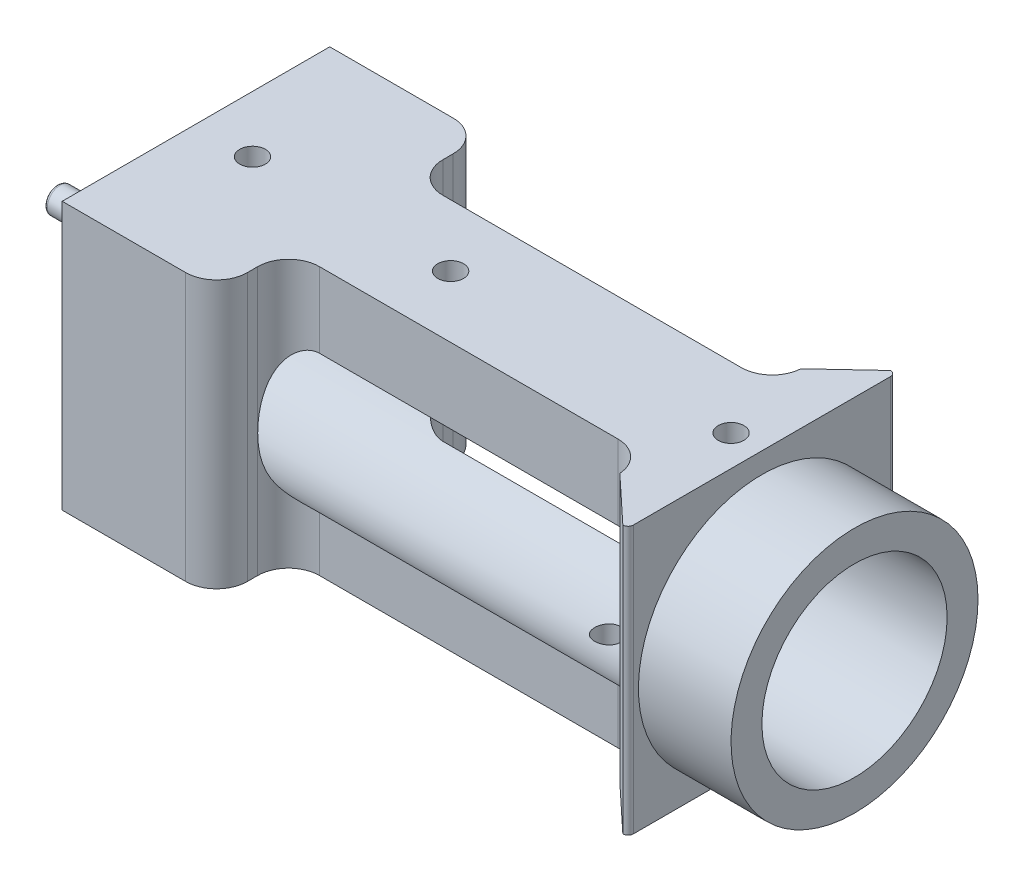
ISO-10303-21;
HEADER;
FILE_DESCRIPTION(('STEP AP214'),'2;1');
FILE_NAME('part.step','',(''),(''),'','','');
FILE_SCHEMA(('AUTOMOTIVE_DESIGN { 1 0 10303 214 1 1 1 1 }'));
ENDSEC;
DATA;
#1=APPLICATION_CONTEXT('core data for automotive mechanical design processes');
#2=APPLICATION_PROTOCOL_DEFINITION('international standard','automotive_design',2000,#1);
#3=PRODUCT_CONTEXT('',#1,'mechanical');
#4=PRODUCT('Part','Part','',(#3));
#5=PRODUCT_RELATED_PRODUCT_CATEGORY('part','',(#4));
#6=PRODUCT_DEFINITION_FORMATION('','',#4);
#7=PRODUCT_DEFINITION_CONTEXT('part definition',#1,'design');
#8=PRODUCT_DEFINITION('design','',#6,#7);
#9=PRODUCT_DEFINITION_SHAPE('','',#8);
#10=(LENGTH_UNIT() NAMED_UNIT(*) SI_UNIT(.MILLI.,.METRE.));
#11=(NAMED_UNIT(*) PLANE_ANGLE_UNIT() SI_UNIT($,.RADIAN.));
#12=(NAMED_UNIT(*) SI_UNIT($,.STERADIAN.) SOLID_ANGLE_UNIT());
#13=UNCERTAINTY_MEASURE_WITH_UNIT(LENGTH_MEASURE(1.E-05),#10,'distance_accuracy_value','');
#14=(GEOMETRIC_REPRESENTATION_CONTEXT(3) GLOBAL_UNCERTAINTY_ASSIGNED_CONTEXT((#13)) GLOBAL_UNIT_ASSIGNED_CONTEXT((#10,
#11,#12)) REPRESENTATION_CONTEXT('',''));
#15=CARTESIAN_POINT('',(0.,0.,0.));
#16=DIRECTION('',(0.,0.,1.));
#17=DIRECTION('',(1.,0.,0.));
#18=AXIS2_PLACEMENT_3D('',#15,#16,#17);
#19=CARTESIAN_POINT('',(25.,-12.001,-4.));
#20=DIRECTION('',(-1.,0.,0.));
#21=DIRECTION('',(0.,0.,1.));
#22=AXIS2_PLACEMENT_3D('',#19,#20,#21);
#23=PLANE('',#22);
#24=CARTESIAN_POINT('',(25.,11.5,10.5));
#25=DIRECTION('',(-1.,0.,0.));
#26=DIRECTION('',(0.,0.,1.));
#27=AXIS2_PLACEMENT_3D('',#24,#25,#26);
#28=CIRCLE('',#27,1.25);
#29=CARTESIAN_POINT('',(25.,11.5,11.75));
#30=VERTEX_POINT('',#29);
#31=EDGE_CURVE('E809',#30,#30,#28,.T.);
#32=ORIENTED_EDGE('',*,*,#31,.F.);
#33=EDGE_LOOP('',(#32));
#34=FACE_BOUND('',#33,.T.);
#35=CARTESIAN_POINT('',(25.,11.5,-10.5));
#36=DIRECTION('',(-1.,0.,0.));
#37=DIRECTION('',(0.,0.,1.));
#38=AXIS2_PLACEMENT_3D('',#35,#36,#37);
#39=CIRCLE('',#38,1.025);
#40=CARTESIAN_POINT('',(25.,11.5,-9.475));
#41=VERTEX_POINT('',#40);
#42=EDGE_CURVE('E241',#41,#41,#39,.T.);
#43=ORIENTED_EDGE('',*,*,#42,.F.);
#44=EDGE_LOOP('',(#43));
#45=FACE_BOUND('',#44,.T.);
#46=CARTESIAN_POINT('',(25.,-9.50000000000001,10.5));
#47=DIRECTION('',(-1.,0.,0.));
#48=DIRECTION('',(0.,0.,1.));
#49=AXIS2_PLACEMENT_3D('',#46,#47,#48);
#50=CIRCLE('',#49,1.025);
#51=CARTESIAN_POINT('',(25.,-9.50000000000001,11.525));
#52=VERTEX_POINT('',#51);
#53=EDGE_CURVE('E240',#52,#52,#50,.T.);
#54=ORIENTED_EDGE('',*,*,#53,.F.);
#55=EDGE_LOOP('',(#54));
#56=FACE_BOUND('',#55,.T.);
#57=DIRECTION('',(0.,0.,1.));
#58=VECTOR('',#57,1.);
#59=CARTESIAN_POINT('',(25.,14.,-4.));
#60=LINE('',#59,#58);
#61=CARTESIAN_POINT('',(25.,14.,-13.));
#62=VERTEX_POINT('',#61);
#63=CARTESIAN_POINT('',(25.,14.,13.));
#64=VERTEX_POINT('',#63);
#65=EDGE_CURVE('E272',#62,#64,#60,.T.);
#66=ORIENTED_EDGE('',*,*,#65,.F.);
#67=DIRECTION('',(0.,-1.,0.));
#68=VECTOR('',#67,1.);
#69=CARTESIAN_POINT('',(25.,14.,-13.));
#70=LINE('',#69,#68);
#71=CARTESIAN_POINT('',(25.,-12.,-13.));
#72=VERTEX_POINT('',#71);
#73=EDGE_CURVE('E253',#62,#72,#70,.T.);
#74=ORIENTED_EDGE('',*,*,#73,.T.);
#75=DIRECTION('',(0.,0.,1.));
#76=VECTOR('',#75,1.);
#77=CARTESIAN_POINT('',(25.,-12.,-13.));
#78=LINE('',#77,#76);
#79=CARTESIAN_POINT('',(25.,-12.,13.));
#80=VERTEX_POINT('',#79);
#81=EDGE_CURVE('E256',#72,#80,#78,.T.);
#82=ORIENTED_EDGE('',*,*,#81,.T.);
#83=DIRECTION('',(0.,1.,0.));
#84=VECTOR('',#83,1.);
#85=CARTESIAN_POINT('',(25.,14.,13.));
#86=LINE('',#85,#84);
#87=EDGE_CURVE('E259',#80,#64,#86,.T.);
#88=ORIENTED_EDGE('',*,*,#87,.T.);
#89=EDGE_LOOP('',(#66,#74,#82,#88));
#90=FACE_BOUND('',#89,.T.);
#91=CARTESIAN_POINT('',(25.,0.,0.));
#92=DIRECTION('',(-1.,0.,0.));
#93=DIRECTION('',(0.,0.,1.));
#94=AXIS2_PLACEMENT_3D('',#91,#92,#93);
#95=CIRCLE('',#94,11.25);
#96=CARTESIAN_POINT('',(25.,0.,11.25));
#97=VERTEX_POINT('',#96);
#98=EDGE_CURVE('E819',#97,#97,#95,.T.);
#99=ORIENTED_EDGE('',*,*,#98,.F.);
#100=EDGE_LOOP('',(#99));
#101=FACE_BOUND('',#100,.T.);
#102=CARTESIAN_POINT('',(25.,-9.5,-10.5));
#103=DIRECTION('',(-1.,0.,0.));
#104=DIRECTION('',(0.,0.,1.));
#105=AXIS2_PLACEMENT_3D('',#102,#103,#104);
#106=CIRCLE('',#105,1.25);
#107=CARTESIAN_POINT('',(25.,-9.5,-9.25));
#108=VERTEX_POINT('',#107);
#109=EDGE_CURVE('E810',#108,#108,#106,.T.);
#110=ORIENTED_EDGE('',*,*,#109,.F.);
#111=EDGE_LOOP('',(#110));
#112=FACE_BOUND('',#111,.T.);
#113=ADVANCED_FACE('F40',(#34,#45,#56,#90,#101,#112),#23,.T.);
#114=CARTESIAN_POINT('',(80.,0.,0.));
#115=DIRECTION('',(1.,0.,0.));
#116=DIRECTION('',(0.,0.,-1.));
#117=AXIS2_PLACEMENT_3D('',#114,#115,#116);
#118=PLANE('',#117);
#119=DIRECTION('',(0.,0.,-1.));
#120=VECTOR('',#119,1.);
#121=CARTESIAN_POINT('',(80.,-12.,0.));
#122=LINE('',#121,#120);
#123=CARTESIAN_POINT('',(80.,-12.,12.5));
#124=VERTEX_POINT('',#123);
#125=CARTESIAN_POINT('',(80.,-12.,0.));
#126=VERTEX_POINT('',#125);
#127=EDGE_CURVE('E319',#124,#126,#122,.T.);
#128=ORIENTED_EDGE('',*,*,#127,.T.);
#129=CARTESIAN_POINT('',(80.,0.,0.));
#130=DIRECTION('',(1.,0.,0.));
#131=DIRECTION('',(0.,0.,-1.));
#132=AXIS2_PLACEMENT_3D('',#129,#130,#131);
#133=CIRCLE('',#132,12.);
#134=EDGE_CURVE('E53',#126,#126,#133,.T.);
#135=ORIENTED_EDGE('',*,*,#134,.F.);
#136=CARTESIAN_POINT('',(80.,-12.,-12.5));
#137=VERTEX_POINT('',#136);
#138=EDGE_CURVE('E318',#126,#137,#122,.T.);
#139=ORIENTED_EDGE('',*,*,#138,.T.);
#140=DIRECTION('',(0.,1.,0.));
#141=VECTOR('',#140,1.);
#142=CARTESIAN_POINT('',(80.,0.,-12.5));
#143=LINE('',#142,#141);
#144=CARTESIAN_POINT('',(80.,14.,-12.5));
#145=VERTEX_POINT('',#144);
#146=EDGE_CURVE('E585',#137,#145,#143,.T.);
#147=ORIENTED_EDGE('',*,*,#146,.T.);
#148=DIRECTION('',(0.,0.,-1.));
#149=VECTOR('',#148,1.);
#150=CARTESIAN_POINT('',(80.,14.,0.));
#151=LINE('',#150,#149);
#152=CARTESIAN_POINT('',(80.,14.,12.5));
#153=VERTEX_POINT('',#152);
#154=EDGE_CURVE('E315',#153,#145,#151,.T.);
#155=ORIENTED_EDGE('',*,*,#154,.F.);
#156=DIRECTION('',(0.,1.,0.));
#157=VECTOR('',#156,1.);
#158=CARTESIAN_POINT('',(80.,-12.,12.5));
#159=LINE('',#158,#157);
#160=EDGE_CURVE('E583',#153,#124,#159,.F.);
#161=ORIENTED_EDGE('',*,*,#160,.T.);
#162=EDGE_LOOP('',(#128,#135,#139,#147,#155,#161));
#163=FACE_BOUND('',#162,.T.);
#164=ADVANCED_FACE('F405',(#163),#118,.T.);
#165=CARTESIAN_POINT('',(80.,0.,0.));
#166=DIRECTION('',(-1.,0.,0.));
#167=DIRECTION('',(0.,0.,1.));
#168=AXIS2_PLACEMENT_3D('',#165,#166,#167);
#169=CYLINDRICAL_SURFACE('',#168,9.);
#170=CARTESIAN_POINT('',(89.,0.,0.));
#171=DIRECTION('',(1.,0.,0.));
#172=DIRECTION('',(0.,0.,-1.));
#173=AXIS2_PLACEMENT_3D('',#170,#171,#172);
#174=CIRCLE('',#173,9.);
#175=CARTESIAN_POINT('',(89.,0.,-9.));
#176=VERTEX_POINT('',#175);
#177=EDGE_CURVE('E836',#176,#176,#174,.T.);
#178=ORIENTED_EDGE('',*,*,#177,.T.);
#179=EDGE_LOOP('',(#178));
#180=FACE_BOUND('',#179,.T.);
#181=CARTESIAN_POINT('',(27.,0.,0.));
#182=DIRECTION('',(-1.,0.,0.));
#183=DIRECTION('',(0.,0.,1.));
#184=AXIS2_PLACEMENT_3D('',#181,#182,#183);
#185=CIRCLE('',#184,9.);
#186=CARTESIAN_POINT('',(27.,0.,9.));
#187=VERTEX_POINT('',#186);
#188=EDGE_CURVE('E247',#187,#187,#185,.T.);
#189=ORIENTED_EDGE('',*,*,#188,.T.);
#190=EDGE_LOOP('',(#189));
#191=FACE_BOUND('',#190,.T.);
#192=CARTESIAN_POINT('',(72.,6.70820393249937,-6.));
#193=CARTESIAN_POINT('',(72.0667206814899,6.70820818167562,-5.99998601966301));
#194=CARTESIAN_POINT('',(72.1334349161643,6.70621322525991,-6.00222545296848));
#195=CARTESIAN_POINT('',(72.266310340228,6.69825895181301,-6.0111057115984));
#196=CARTESIAN_POINT('',(72.3324717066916,6.69230095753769,-6.01774506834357));
#197=CARTESIAN_POINT('',(72.4634349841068,6.67649221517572,-6.03527816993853));
#198=CARTESIAN_POINT('',(72.5282418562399,6.66666007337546,-6.04615157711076));
#199=CARTESIAN_POINT('',(72.6563239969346,6.64317719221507,-6.07194365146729));
#200=CARTESIAN_POINT('',(72.7195992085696,6.62952631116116,-6.08686246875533));
#201=CARTESIAN_POINT('',(72.9063521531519,6.58298828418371,-6.13729394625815));
#202=CARTESIAN_POINT('',(73.0269835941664,6.54448830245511,-6.17851310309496));
#203=CARTESIAN_POINT('',(73.2575492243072,6.45355215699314,-6.27343229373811));
#204=CARTESIAN_POINT('',(73.3674754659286,6.40110574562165,-6.32714150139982));
#205=CARTESIAN_POINT('',(73.5790472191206,6.28124111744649,-6.44619352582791));
#206=CARTESIAN_POINT('',(73.6801829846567,6.21330628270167,-6.51191688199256));
#207=CARTESIAN_POINT('',(73.8682526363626,6.0654631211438,-6.64983915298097));
#208=CARTESIAN_POINT('',(73.9551797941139,5.98554915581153,-6.72204111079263));
#209=CARTESIAN_POINT('',(74.0961472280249,5.8356549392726,-6.85219276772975));
#210=CARTESIAN_POINT('',(74.153104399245,5.76779113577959,-6.90947756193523));
#211=CARTESIAN_POINT('',(74.2593331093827,5.62680952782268,-7.02476356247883));
#212=CARTESIAN_POINT('',(74.3086013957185,5.55368951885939,-7.08276506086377));
#213=CARTESIAN_POINT('',(74.4000407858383,5.40278406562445,-7.19854043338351));
#214=CARTESIAN_POINT('',(74.4422009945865,5.32499170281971,-7.25631382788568));
#215=CARTESIAN_POINT('',(74.5199928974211,5.16541890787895,-7.37075987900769));
#216=CARTESIAN_POINT('',(74.5556223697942,5.08363713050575,-7.42743215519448));
#217=CARTESIAN_POINT('',(74.637919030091,4.8734605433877,-7.56786281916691));
#218=CARTESIAN_POINT('',(74.6807794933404,4.7428112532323,-7.65048923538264));
#219=CARTESIAN_POINT('',(74.7553553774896,4.47505994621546,-7.81013334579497));
#220=CARTESIAN_POINT('',(74.7870647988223,4.33795450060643,-7.88714800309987));
#221=CARTESIAN_POINT('',(74.8415412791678,4.05819660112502,-8.03468125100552));
#222=CARTESIAN_POINT('',(74.8642881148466,3.91553239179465,-8.10518487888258));
#223=CARTESIAN_POINT('',(74.902666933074,3.62586088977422,-8.23884728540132));
#224=CARTESIAN_POINT('',(74.9182968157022,3.4788523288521,-8.30200389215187));
#225=CARTESIAN_POINT('',(74.9504979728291,3.1079197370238,-8.44973141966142));
#226=CARTESIAN_POINT('',(74.9637381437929,2.88178965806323,-8.52951966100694));
#227=CARTESIAN_POINT('',(74.9827424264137,2.42353089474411,-8.6708749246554));
#228=CARTESIAN_POINT('',(74.9885022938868,2.19139888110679,-8.73243158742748));
#229=CARTESIAN_POINT('',(74.9960090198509,1.72327448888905,-8.8367269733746));
#230=CARTESIAN_POINT('',(74.9977620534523,1.48728861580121,-8.87949457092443));
#231=CARTESIAN_POINT('',(74.9997008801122,1.01277816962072,-8.94603953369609));
#232=CARTESIAN_POINT('',(74.9998877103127,0.774255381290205,-8.96982945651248));
#233=CARTESIAN_POINT('',(74.9999838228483,0.446063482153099,-8.98938347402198));
#234=CARTESIAN_POINT('',(74.9999936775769,0.356827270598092,-8.99336732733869));
#235=CARTESIAN_POINT('',(75.0000010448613,0.178396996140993,-8.9986735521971));
#236=CARTESIAN_POINT('',(74.9999985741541,0.0892030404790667,-8.99999952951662));
#237=CARTESIAN_POINT('',(75.,0.,-9.));
#238=B_SPLINE_CURVE_WITH_KNOTS('',3,(#192,#193,#194,#195,#196,#197,#198,#199,#200,#201,#202,
#203,#204,#205,#206,#207,#208,#209,#210,#211,#212,#213,#214,#215,#216,#217,#218,#219,#220,#221,
#222,#223,#224,#225,#226,#227,#228,#229,#230,#231,#232,#233,#234,#235,#236,#237),.UNSPECIFIED.,
.F.,.F.,(4,2,2,2,2,2,2,2,2,2,2,2,2,2,2,2,2,2,2,2,2,2,4),(0.,0.200083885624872,0.400101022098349,
0.599169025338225,0.79824441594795,1.19571366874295,1.59347578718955,2.00720970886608,
2.42113898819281,2.73723338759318,3.0534611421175,3.37016927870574,3.68698495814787,
4.16746974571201,4.64821265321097,5.13003418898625,5.61199779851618,6.33144893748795,
7.05130810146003,7.77005710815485,8.4883301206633,8.75627497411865,9.02385607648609),.UNSPECIFIED.);
#239=CARTESIAN_POINT('',(72.,6.70820393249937,-6.));
#240=VERTEX_POINT('',#239);
#241=CARTESIAN_POINT('',(74.9933259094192,1.88679622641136,-8.79999999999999));
#242=VERTEX_POINT('',#241);
#243=EDGE_CURVE('E415',#240,#242,#238,.T.);
#244=ORIENTED_EDGE('',*,*,#243,.T.);
#245=CARTESIAN_POINT('',(65.5857301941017,0.,0.));
#246=DIRECTION('',(-0.683130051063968,0.,-0.730296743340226));
#247=DIRECTION('',(-0.730296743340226,0.,0.683130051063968));
#248=AXIS2_PLACEMENT_3D('',#245,#246,#247);
#249=ELLIPSE('',#248,13.1746509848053,9.);
#250=CARTESIAN_POINT('',(74.9933259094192,-1.88679622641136,-8.79999999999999));
#251=VERTEX_POINT('',#250);
#252=EDGE_CURVE('E632',#242,#251,#249,.T.);
#253=ORIENTED_EDGE('',*,*,#252,.T.);
#254=CARTESIAN_POINT('',(75.,0.,-9.));
#255=CARTESIAN_POINT('',(74.9999853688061,-0.125771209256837,-9.00000149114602));
#256=CARTESIAN_POINT('',(74.9999996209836,-0.251541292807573,-8.99736360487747));
#257=CARTESIAN_POINT('',(74.9999795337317,-0.502861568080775,-8.98682045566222));
#258=CARTESIAN_POINT('',(74.9999451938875,-0.628411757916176,-8.97891514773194));
#259=CARTESIAN_POINT('',(74.9997214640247,-0.879180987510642,-8.95783941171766));
#260=CARTESIAN_POINT('',(74.9995319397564,-1.00439964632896,-8.9446644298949));
#261=CARTESIAN_POINT('',(74.9987813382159,-1.25416428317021,-8.91307588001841));
#262=CARTESIAN_POINT('',(74.9982202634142,-1.37871026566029,-8.89466234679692));
#263=CARTESIAN_POINT('',(74.9955571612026,-1.75324249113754,-8.83122983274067));
#264=CARTESIAN_POINT('',(74.9924680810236,-2.00191527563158,-8.77820393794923));
#265=CARTESIAN_POINT('',(74.9803550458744,-2.49362605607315,-8.65137173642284));
#266=CARTESIAN_POINT('',(74.9713347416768,-2.73666742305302,-8.5775782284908));
#267=CARTESIAN_POINT('',(74.9477656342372,-3.1294362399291,-8.43997241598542));
#268=CARTESIAN_POINT('',(74.9363509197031,-3.28142894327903,-8.3820402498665));
#269=CARTESIAN_POINT('',(74.9075479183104,-3.58160086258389,-8.25823684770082));
#270=CARTESIAN_POINT('',(74.8901596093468,-3.72978006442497,-8.19236558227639));
#271=CARTESIAN_POINT('',(74.8476795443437,-4.02095132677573,-8.05343889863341));
#272=CARTESIAN_POINT('',(74.8226159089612,-4.16396022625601,-7.98041035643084));
#273=CARTESIAN_POINT('',(74.7627080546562,-4.44429346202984,-7.82775109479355));
#274=CARTESIAN_POINT('',(74.727867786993,-4.58162006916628,-7.74812305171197));
#275=CARTESIAN_POINT('',(74.6594246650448,-4.80569864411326,-7.61028973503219));
#276=CARTESIAN_POINT('',(74.6291111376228,-4.89436147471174,-7.55354905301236));
#277=CARTESIAN_POINT('',(74.5622447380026,-5.06800311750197,-7.43815837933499));
#278=CARTESIAN_POINT('',(74.5256936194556,-5.15298295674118,-7.37950892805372));
#279=CARTESIAN_POINT('',(74.4456132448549,-5.31865415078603,-7.26101074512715));
#280=CARTESIAN_POINT('',(74.4020884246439,-5.39934818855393,-7.20116279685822));
#281=CARTESIAN_POINT('',(74.3073538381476,-5.55580447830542,-7.08115599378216));
#282=CARTESIAN_POINT('',(74.2561462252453,-5.63156810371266,-7.02099723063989));
#283=CARTESIAN_POINT('',(74.1163294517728,-5.81572213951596,-6.87007629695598));
#284=CARTESIAN_POINT('',(74.0221791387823,-5.92041509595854,-6.77978986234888));
#285=CARTESIAN_POINT('',(73.813175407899,-6.11362322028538,-6.60609530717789));
#286=CARTESIAN_POINT('',(73.6983461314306,-6.20215701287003,-6.52267932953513));
#287=CARTESIAN_POINT('',(73.4687010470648,-6.34734462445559,-6.38120792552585));
#288=CARTESIAN_POINT('',(73.3568702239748,-6.40683719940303,-6.32123211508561));
#289=CARTESIAN_POINT('',(73.1206825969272,-6.51072717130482,-6.21417895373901));
#290=CARTESIAN_POINT('',(72.9963402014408,-6.55514168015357,-6.16708699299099));
#291=CARTESIAN_POINT('',(72.7990308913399,-6.61055893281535,-6.10747883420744));
#292=CARTESIAN_POINT('',(72.7293902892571,-6.62745333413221,-6.08911546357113));
#293=CARTESIAN_POINT('',(72.5880129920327,-6.6565439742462,-6.05730028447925));
#294=CARTESIAN_POINT('',(72.516276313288,-6.66874024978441,-6.04384843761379));
#295=CARTESIAN_POINT('',(72.370845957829,-6.68839202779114,-6.02209609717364));
#296=CARTESIAN_POINT('',(72.2971418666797,-6.69581253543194,-6.01383363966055));
#297=CARTESIAN_POINT('',(72.1489621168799,-6.70572301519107,-6.00277340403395));
#298=CARTESIAN_POINT('',(72.0744861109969,-6.70821066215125,-5.99997820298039));
#299=CARTESIAN_POINT('',(72.,-6.70820393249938,-6.));
#300=B_SPLINE_CURVE_WITH_KNOTS('',3,(#254,#255,#256,#257,#258,#259,#260,#261,#262,#263,#264,
#265,#266,#267,#268,#269,#270,#271,#272,#273,#274,#275,#276,#277,#278,#279,#280,#281,#282,#283,
#284,#285,#286,#287,#288,#289,#290,#291,#292,#293,#294,#295,#296,#297,#298,#299),.UNSPECIFIED.,
.F.,.F.,(4,2,2,2,2,2,2,2,2,2,2,2,2,2,2,2,2,2,2,2,2,2,4),(0.,0.377283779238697,0.754570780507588,
1.13218451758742,1.50979574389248,2.27164317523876,3.03302211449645,3.52190312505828,
4.01078594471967,4.49789861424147,4.98481469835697,5.31322211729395,5.64153735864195,
5.9696445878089,6.29766002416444,6.79749252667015,7.29674524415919,7.71547436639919,
8.13372667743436,8.35536495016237,8.57700148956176,8.80024413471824,9.02359198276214),.UNSPECIFIED.);
#301=CARTESIAN_POINT('',(72.,-6.70820393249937,-6.));
#302=VERTEX_POINT('',#301);
#303=EDGE_CURVE('E387',#251,#302,#300,.T.);
#304=ORIENTED_EDGE('',*,*,#303,.T.);
#305=DIRECTION('',(-1.,0.,0.));
#306=VECTOR('',#305,1.);
#307=CARTESIAN_POINT('',(80.,-6.70820393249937,-6.));
#308=LINE('',#307,#306);
#309=CARTESIAN_POINT('',(43.,-6.70820393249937,-6.));
#310=VERTEX_POINT('',#309);
#311=EDGE_CURVE('E294',#302,#310,#308,.T.);
#312=ORIENTED_EDGE('',*,*,#311,.T.);
#313=CARTESIAN_POINT('',(43.,-6.70820393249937,-6.));
#314=CARTESIAN_POINT('',(42.9332793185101,-6.70820818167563,-5.99998601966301));
#315=CARTESIAN_POINT('',(42.8665650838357,-6.70621322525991,-6.00222545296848));
#316=CARTESIAN_POINT('',(42.733689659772,-6.69825895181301,-6.0111057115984));
#317=CARTESIAN_POINT('',(42.6675282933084,-6.69230095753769,-6.01774506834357));
#318=CARTESIAN_POINT('',(42.5365650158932,-6.67649221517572,-6.03527816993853));
#319=CARTESIAN_POINT('',(42.4717581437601,-6.66666007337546,-6.04615157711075));
#320=CARTESIAN_POINT('',(42.3436760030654,-6.64317719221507,-6.07194365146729));
#321=CARTESIAN_POINT('',(42.2804007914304,-6.62952631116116,-6.08686246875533));
#322=CARTESIAN_POINT('',(42.0936478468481,-6.58298828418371,-6.13729394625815));
#323=CARTESIAN_POINT('',(41.9730164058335,-6.5444883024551,-6.17851310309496));
#324=CARTESIAN_POINT('',(41.7424507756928,-6.45355215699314,-6.27343229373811));
#325=CARTESIAN_POINT('',(41.6325245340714,-6.40110574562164,-6.32714150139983));
#326=CARTESIAN_POINT('',(41.4209527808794,-6.28124111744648,-6.44619352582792));
#327=CARTESIAN_POINT('',(41.3198170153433,-6.21330628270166,-6.51191688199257));
#328=CARTESIAN_POINT('',(41.1317473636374,-6.0654631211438,-6.64983915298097));
#329=CARTESIAN_POINT('',(41.0448202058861,-5.98554915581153,-6.72204111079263));
#330=CARTESIAN_POINT('',(40.9038527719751,-5.8356549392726,-6.85219276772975));
#331=CARTESIAN_POINT('',(40.846895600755,-5.76779113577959,-6.90947756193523));
#332=CARTESIAN_POINT('',(40.7406668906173,-5.62680952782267,-7.02476356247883));
#333=CARTESIAN_POINT('',(40.6913986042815,-5.55368951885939,-7.08276506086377));
#334=CARTESIAN_POINT('',(40.5999592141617,-5.40278406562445,-7.19854043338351));
#335=CARTESIAN_POINT('',(40.5577990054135,-5.32499170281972,-7.25631382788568));
#336=CARTESIAN_POINT('',(40.4800071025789,-5.16541890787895,-7.37075987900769));
#337=CARTESIAN_POINT('',(40.4443776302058,-5.08363713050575,-7.42743215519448));
#338=CARTESIAN_POINT('',(40.362080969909,-4.8734605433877,-7.56786281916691));
#339=CARTESIAN_POINT('',(40.3192205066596,-4.7428112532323,-7.65048923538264));
#340=CARTESIAN_POINT('',(40.2446446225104,-4.47505994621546,-7.81013334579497));
#341=CARTESIAN_POINT('',(40.2129352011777,-4.33795450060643,-7.88714800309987));
#342=CARTESIAN_POINT('',(40.1584587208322,-4.05819660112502,-8.03468125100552));
#343=CARTESIAN_POINT('',(40.1357118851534,-3.91553239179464,-8.10518487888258));
#344=CARTESIAN_POINT('',(40.097333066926,-3.62586088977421,-8.23884728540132));
#345=CARTESIAN_POINT('',(40.0817031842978,-3.47885232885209,-8.30200389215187));
#346=CARTESIAN_POINT('',(40.0495020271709,-3.10791973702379,-8.44973141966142));
#347=CARTESIAN_POINT('',(40.0362618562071,-2.88178965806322,-8.52951966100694));
#348=CARTESIAN_POINT('',(40.0172575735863,-2.4235308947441,-8.6708749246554));
#349=CARTESIAN_POINT('',(40.0114977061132,-2.19139888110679,-8.73243158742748));
#350=CARTESIAN_POINT('',(40.0039909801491,-1.72327448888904,-8.83672697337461));
#351=CARTESIAN_POINT('',(40.0022379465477,-1.4872886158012,-8.87949457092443));
#352=CARTESIAN_POINT('',(40.0002991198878,-1.01277816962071,-8.94603953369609));
#353=CARTESIAN_POINT('',(40.0001122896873,-0.774255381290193,-8.96982945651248));
#354=CARTESIAN_POINT('',(40.0000161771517,-0.446063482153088,-8.98938347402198));
#355=CARTESIAN_POINT('',(40.0000063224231,-0.356827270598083,-8.99336732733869));
#356=CARTESIAN_POINT('',(39.9999989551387,-0.178396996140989,-8.9986735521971));
#357=CARTESIAN_POINT('',(40.0000014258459,-0.0892030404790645,-8.99999952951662));
#358=CARTESIAN_POINT('',(40.,0.,-9.));
#359=B_SPLINE_CURVE_WITH_KNOTS('',3,(#313,#314,#315,#316,#317,#318,#319,#320,#321,#322,#323,
#324,#325,#326,#327,#328,#329,#330,#331,#332,#333,#334,#335,#336,#337,#338,#339,#340,#341,#342,
#343,#344,#345,#346,#347,#348,#349,#350,#351,#352,#353,#354,#355,#356,#357,#358),.UNSPECIFIED.,
.F.,.F.,(4,2,2,2,2,2,2,2,2,2,2,2,2,2,2,2,2,2,2,2,2,2,4),(0.,0.200083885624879,0.400101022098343,
0.599169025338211,0.79824441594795,1.19571366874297,1.59347578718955,2.00720970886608,
2.42113898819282,2.73723338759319,3.0534611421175,3.37016927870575,3.68698495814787,
4.16746974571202,4.64821265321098,5.13003418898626,5.61199779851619,6.33144893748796,
7.05130810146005,7.77005710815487,8.48833012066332,8.75627497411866,9.02385607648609),.UNSPECIFIED.);
#360=CARTESIAN_POINT('',(40.,0.,-9.));
#361=VERTEX_POINT('',#360);
#362=EDGE_CURVE('E422',#310,#361,#359,.T.);
#363=ORIENTED_EDGE('',*,*,#362,.T.);
#364=CARTESIAN_POINT('',(40.,0.,-9.));
#365=CARTESIAN_POINT('',(40.0000146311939,0.125771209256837,-9.00000149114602));
#366=CARTESIAN_POINT('',(40.0000003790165,0.251541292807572,-8.99736360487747));
#367=CARTESIAN_POINT('',(40.0000204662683,0.502861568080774,-8.98682045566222));
#368=CARTESIAN_POINT('',(40.0000548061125,0.628411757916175,-8.97891514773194));
#369=CARTESIAN_POINT('',(40.0002785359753,0.879180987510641,-8.95783941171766));
#370=CARTESIAN_POINT('',(40.0004680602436,1.00439964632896,-8.9446644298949));
#371=CARTESIAN_POINT('',(40.0012186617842,1.25416428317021,-8.91307588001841));
#372=CARTESIAN_POINT('',(40.0017797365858,1.37871026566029,-8.89466234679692));
#373=CARTESIAN_POINT('',(40.0044428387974,1.75324249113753,-8.83122983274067));
#374=CARTESIAN_POINT('',(40.0075319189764,2.00191527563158,-8.77820393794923));
#375=CARTESIAN_POINT('',(40.0196449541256,2.49362605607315,-8.65137173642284));
#376=CARTESIAN_POINT('',(40.0286652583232,2.73666742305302,-8.5775782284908));
#377=CARTESIAN_POINT('',(40.0522343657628,3.1294362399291,-8.43997241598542));
#378=CARTESIAN_POINT('',(40.0636490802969,3.28142894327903,-8.3820402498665));
#379=CARTESIAN_POINT('',(40.0924520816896,3.58160086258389,-8.25823684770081));
#380=CARTESIAN_POINT('',(40.1098403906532,3.72978006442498,-8.19236558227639));
#381=CARTESIAN_POINT('',(40.1523204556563,4.02095132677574,-8.05343889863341));
#382=CARTESIAN_POINT('',(40.1773840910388,4.16396022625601,-7.98041035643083));
#383=CARTESIAN_POINT('',(40.2372919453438,4.44429346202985,-7.82775109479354));
#384=CARTESIAN_POINT('',(40.272132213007,4.58162006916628,-7.74812305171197));
#385=CARTESIAN_POINT('',(40.3405753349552,4.80569864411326,-7.61028973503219));
#386=CARTESIAN_POINT('',(40.3708888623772,4.89436147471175,-7.55354905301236));
#387=CARTESIAN_POINT('',(40.4377552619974,5.06800311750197,-7.43815837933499));
#388=CARTESIAN_POINT('',(40.4743063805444,5.15298295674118,-7.37950892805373));
#389=CARTESIAN_POINT('',(40.5543867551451,5.31865415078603,-7.26101074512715));
#390=CARTESIAN_POINT('',(40.5979115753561,5.39934818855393,-7.20116279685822));
#391=CARTESIAN_POINT('',(40.6926461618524,5.55580447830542,-7.08115599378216));
#392=CARTESIAN_POINT('',(40.7438537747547,5.63156810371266,-7.02099723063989));
#393=CARTESIAN_POINT('',(40.8836705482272,5.81572213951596,-6.87007629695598));
#394=CARTESIAN_POINT('',(40.9778208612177,5.92041509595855,-6.77978986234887));
#395=CARTESIAN_POINT('',(41.186824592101,6.11362322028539,-6.60609530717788));
#396=CARTESIAN_POINT('',(41.3016538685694,6.20215701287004,-6.52267932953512));
#397=CARTESIAN_POINT('',(41.5312989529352,6.34734462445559,-6.38120792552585));
#398=CARTESIAN_POINT('',(41.6431297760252,6.40683719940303,-6.32123211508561));
#399=CARTESIAN_POINT('',(41.8793174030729,6.51072717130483,-6.21417895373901));
#400=CARTESIAN_POINT('',(42.0036597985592,6.55514168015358,-6.16708699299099));
#401=CARTESIAN_POINT('',(42.2009691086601,6.61055893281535,-6.10747883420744));
#402=CARTESIAN_POINT('',(42.2706097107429,6.62745333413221,-6.08911546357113));
#403=CARTESIAN_POINT('',(42.4119870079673,6.6565439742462,-6.05730028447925));
#404=CARTESIAN_POINT('',(42.483723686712,6.66874024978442,-6.04384843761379));
#405=CARTESIAN_POINT('',(42.6291540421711,6.68839202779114,-6.02209609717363));
#406=CARTESIAN_POINT('',(42.7028581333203,6.69581253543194,-6.01383363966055));
#407=CARTESIAN_POINT('',(42.8510378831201,6.70572301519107,-6.00277340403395));
#408=CARTESIAN_POINT('',(42.9255138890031,6.70821066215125,-5.99997820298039));
#409=CARTESIAN_POINT('',(43.,6.70820393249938,-6.));
#410=B_SPLINE_CURVE_WITH_KNOTS('',3,(#364,#365,#366,#367,#368,#369,#370,#371,#372,#373,#374,
#375,#376,#377,#378,#379,#380,#381,#382,#383,#384,#385,#386,#387,#388,#389,#390,#391,#392,#393,
#394,#395,#396,#397,#398,#399,#400,#401,#402,#403,#404,#405,#406,#407,#408,#409),.UNSPECIFIED.,
.F.,.F.,(4,2,2,2,2,2,2,2,2,2,2,2,2,2,2,2,2,2,2,2,2,2,4),(0.,0.377283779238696,0.754570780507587,
1.13218451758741,1.50979574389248,2.27164317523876,3.03302211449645,3.52190312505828,
4.01078594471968,4.49789861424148,4.98481469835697,5.31322211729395,5.64153735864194,
5.9696445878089,6.29766002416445,6.79749252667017,7.29674524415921,7.71547436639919,
8.13372667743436,8.35536495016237,8.57700148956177,8.80024413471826,9.02359198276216),.UNSPECIFIED.);
#411=CARTESIAN_POINT('',(43.,6.70820393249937,-6.));
#412=VERTEX_POINT('',#411);
#413=EDGE_CURVE('E429',#361,#412,#410,.T.);
#414=ORIENTED_EDGE('',*,*,#413,.T.);
#415=DIRECTION('',(-1.,0.,0.));
#416=VECTOR('',#415,1.);
#417=CARTESIAN_POINT('',(80.,6.70820393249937,-6.));
#418=LINE('',#417,#416);
#419=EDGE_CURVE('E289',#412,#240,#418,.F.);
#420=ORIENTED_EDGE('',*,*,#419,.T.);
#421=EDGE_LOOP('',(#244,#253,#304,#312,#363,#414,#420));
#422=FACE_BOUND('',#421,.T.);
#423=CARTESIAN_POINT('',(72.,-6.70820393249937,6.));
#424=CARTESIAN_POINT('',(72.0667206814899,-6.70820818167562,5.99998601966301));
#425=CARTESIAN_POINT('',(72.1334349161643,-6.70621322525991,6.00222545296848));
#426=CARTESIAN_POINT('',(72.266310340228,-6.69825895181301,6.0111057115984));
#427=CARTESIAN_POINT('',(72.3324717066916,-6.69230095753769,6.01774506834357));
#428=CARTESIAN_POINT('',(72.4634349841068,-6.67649221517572,6.03527816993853));
#429=CARTESIAN_POINT('',(72.5282418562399,-6.66666007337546,6.04615157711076));
#430=CARTESIAN_POINT('',(72.6563239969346,-6.64317719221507,6.07194365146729));
#431=CARTESIAN_POINT('',(72.7195992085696,-6.62952631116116,6.08686246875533));
#432=CARTESIAN_POINT('',(72.9063521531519,-6.58298828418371,6.13729394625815));
#433=CARTESIAN_POINT('',(73.0269835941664,-6.54448830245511,6.17851310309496));
#434=CARTESIAN_POINT('',(73.2575492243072,-6.45355215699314,6.27343229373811));
#435=CARTESIAN_POINT('',(73.3674754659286,-6.40110574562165,6.32714150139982));
#436=CARTESIAN_POINT('',(73.5790472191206,-6.28124111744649,6.44619352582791));
#437=CARTESIAN_POINT('',(73.6801829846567,-6.21330628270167,6.51191688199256));
#438=CARTESIAN_POINT('',(73.8682526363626,-6.0654631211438,6.64983915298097));
#439=CARTESIAN_POINT('',(73.9551797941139,-5.98554915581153,6.72204111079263));
#440=CARTESIAN_POINT('',(74.0961472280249,-5.8356549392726,6.85219276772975));
#441=CARTESIAN_POINT('',(74.153104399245,-5.76779113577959,6.90947756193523));
#442=CARTESIAN_POINT('',(74.2593331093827,-5.62680952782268,7.02476356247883));
#443=CARTESIAN_POINT('',(74.3086013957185,-5.55368951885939,7.08276506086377));
#444=CARTESIAN_POINT('',(74.4000407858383,-5.40278406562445,7.19854043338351));
#445=CARTESIAN_POINT('',(74.4422009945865,-5.32499170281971,7.25631382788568));
#446=CARTESIAN_POINT('',(74.5199928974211,-5.16541890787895,7.37075987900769));
#447=CARTESIAN_POINT('',(74.5556223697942,-5.08363713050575,7.42743215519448));
#448=CARTESIAN_POINT('',(74.637919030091,-4.8734605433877,7.56786281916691));
#449=CARTESIAN_POINT('',(74.6807794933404,-4.7428112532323,7.65048923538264));
#450=CARTESIAN_POINT('',(74.7553553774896,-4.47505994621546,7.81013334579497));
#451=CARTESIAN_POINT('',(74.7870647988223,-4.33795450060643,7.88714800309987));
#452=CARTESIAN_POINT('',(74.8415412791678,-4.05819660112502,8.03468125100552));
#453=CARTESIAN_POINT('',(74.8642881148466,-3.91553239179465,8.10518487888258));
#454=CARTESIAN_POINT('',(74.902666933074,-3.62586088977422,8.23884728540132));
#455=CARTESIAN_POINT('',(74.9182968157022,-3.4788523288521,8.30200389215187));
#456=CARTESIAN_POINT('',(74.9504979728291,-3.1079197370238,8.44973141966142));
#457=CARTESIAN_POINT('',(74.9637381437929,-2.88178965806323,8.52951966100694));
#458=CARTESIAN_POINT('',(74.9827424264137,-2.42353089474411,8.6708749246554));
#459=CARTESIAN_POINT('',(74.9885022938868,-2.19139888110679,8.73243158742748));
#460=CARTESIAN_POINT('',(74.9960090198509,-1.72327448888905,8.8367269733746));
#461=CARTESIAN_POINT('',(74.9977620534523,-1.48728861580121,8.87949457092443));
#462=CARTESIAN_POINT('',(74.9997008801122,-1.01277816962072,8.94603953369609));
#463=CARTESIAN_POINT('',(74.9998877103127,-0.774255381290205,8.96982945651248));
#464=CARTESIAN_POINT('',(74.9999838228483,-0.446063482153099,8.98938347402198));
#465=CARTESIAN_POINT('',(74.9999936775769,-0.356827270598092,8.99336732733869));
#466=CARTESIAN_POINT('',(75.0000010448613,-0.178396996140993,8.9986735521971));
#467=CARTESIAN_POINT('',(74.9999985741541,-0.0892030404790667,8.99999952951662));
#468=CARTESIAN_POINT('',(75.,0.,9.));
#469=B_SPLINE_CURVE_WITH_KNOTS('',3,(#423,#424,#425,#426,#427,#428,#429,#430,#431,#432,#433,
#434,#435,#436,#437,#438,#439,#440,#441,#442,#443,#444,#445,#446,#447,#448,#449,#450,#451,#452,
#453,#454,#455,#456,#457,#458,#459,#460,#461,#462,#463,#464,#465,#466,#467,#468),.UNSPECIFIED.,
.F.,.F.,(4,2,2,2,2,2,2,2,2,2,2,2,2,2,2,2,2,2,2,2,2,2,4),(0.,0.200083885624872,0.400101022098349,
0.599169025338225,0.79824441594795,1.19571366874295,1.59347578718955,2.00720970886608,
2.42113898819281,2.73723338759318,3.0534611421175,3.37016927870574,3.68698495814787,
4.16746974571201,4.64821265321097,5.13003418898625,5.61199779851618,6.33144893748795,
7.05130810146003,7.77005710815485,8.4883301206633,8.75627497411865,9.02385607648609),.UNSPECIFIED.);
#470=CARTESIAN_POINT('',(72.,-6.70820393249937,6.));
#471=VERTEX_POINT('',#470);
#472=CARTESIAN_POINT('',(74.9933259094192,-1.88679622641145,8.79999999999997));
#473=VERTEX_POINT('',#472);
#474=EDGE_CURVE('E437',#471,#473,#469,.T.);
#475=ORIENTED_EDGE('',*,*,#474,.T.);
#476=CARTESIAN_POINT('',(65.5857301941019,0.,0.));
#477=DIRECTION('',(0.683130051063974,0.,-0.730296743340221));
#478=DIRECTION('',(-0.730296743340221,0.,-0.683130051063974));
#479=AXIS2_PLACEMENT_3D('',#476,#477,#478);
#480=ELLIPSE('',#479,13.1746509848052,9.);
#481=CARTESIAN_POINT('',(74.9933259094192,1.88679622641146,8.79999999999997));
#482=VERTEX_POINT('',#481);
#483=EDGE_CURVE('E633',#473,#482,#480,.F.);
#484=ORIENTED_EDGE('',*,*,#483,.T.);
#485=CARTESIAN_POINT('',(75.,0.,9.));
#486=CARTESIAN_POINT('',(74.9999853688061,0.125771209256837,9.00000149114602));
#487=CARTESIAN_POINT('',(74.9999996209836,0.251541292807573,8.99736360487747));
#488=CARTESIAN_POINT('',(74.9999795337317,0.502861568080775,8.98682045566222));
#489=CARTESIAN_POINT('',(74.9999451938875,0.628411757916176,8.97891514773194));
#490=CARTESIAN_POINT('',(74.9997214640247,0.879180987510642,8.95783941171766));
#491=CARTESIAN_POINT('',(74.9995319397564,1.00439964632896,8.9446644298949));
#492=CARTESIAN_POINT('',(74.9987813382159,1.25416428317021,8.91307588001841));
#493=CARTESIAN_POINT('',(74.9982202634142,1.37871026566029,8.89466234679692));
#494=CARTESIAN_POINT('',(74.9955571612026,1.75324249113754,8.83122983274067));
#495=CARTESIAN_POINT('',(74.9924680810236,2.00191527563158,8.77820393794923));
#496=CARTESIAN_POINT('',(74.9803550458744,2.49362605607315,8.65137173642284));
#497=CARTESIAN_POINT('',(74.9713347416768,2.73666742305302,8.5775782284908));
#498=CARTESIAN_POINT('',(74.9477656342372,3.1294362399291,8.43997241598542));
#499=CARTESIAN_POINT('',(74.9363509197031,3.28142894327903,8.3820402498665));
#500=CARTESIAN_POINT('',(74.9075479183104,3.58160086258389,8.25823684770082));
#501=CARTESIAN_POINT('',(74.8901596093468,3.72978006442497,8.19236558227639));
#502=CARTESIAN_POINT('',(74.8476795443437,4.02095132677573,8.05343889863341));
#503=CARTESIAN_POINT('',(74.8226159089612,4.16396022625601,7.98041035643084));
#504=CARTESIAN_POINT('',(74.7627080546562,4.44429346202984,7.82775109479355));
#505=CARTESIAN_POINT('',(74.727867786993,4.58162006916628,7.74812305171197));
#506=CARTESIAN_POINT('',(74.6594246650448,4.80569864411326,7.61028973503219));
#507=CARTESIAN_POINT('',(74.6291111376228,4.89436147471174,7.55354905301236));
#508=CARTESIAN_POINT('',(74.5622447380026,5.06800311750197,7.43815837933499));
#509=CARTESIAN_POINT('',(74.5256936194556,5.15298295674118,7.37950892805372));
#510=CARTESIAN_POINT('',(74.4456132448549,5.31865415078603,7.26101074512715));
#511=CARTESIAN_POINT('',(74.4020884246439,5.39934818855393,7.20116279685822));
#512=CARTESIAN_POINT('',(74.3073538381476,5.55580447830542,7.08115599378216));
#513=CARTESIAN_POINT('',(74.2561462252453,5.63156810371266,7.02099723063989));
#514=CARTESIAN_POINT('',(74.1163294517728,5.81572213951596,6.87007629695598));
#515=CARTESIAN_POINT('',(74.0221791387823,5.92041509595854,6.77978986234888));
#516=CARTESIAN_POINT('',(73.813175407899,6.11362322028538,6.60609530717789));
#517=CARTESIAN_POINT('',(73.6983461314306,6.20215701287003,6.52267932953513));
#518=CARTESIAN_POINT('',(73.4687010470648,6.34734462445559,6.38120792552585));
#519=CARTESIAN_POINT('',(73.3568702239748,6.40683719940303,6.32123211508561));
#520=CARTESIAN_POINT('',(73.1206825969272,6.51072717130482,6.21417895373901));
#521=CARTESIAN_POINT('',(72.9963402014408,6.55514168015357,6.16708699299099));
#522=CARTESIAN_POINT('',(72.7990308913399,6.61055893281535,6.10747883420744));
#523=CARTESIAN_POINT('',(72.7293902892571,6.62745333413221,6.08911546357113));
#524=CARTESIAN_POINT('',(72.5880129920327,6.6565439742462,6.05730028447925));
#525=CARTESIAN_POINT('',(72.516276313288,6.66874024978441,6.04384843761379));
#526=CARTESIAN_POINT('',(72.370845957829,6.68839202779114,6.02209609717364));
#527=CARTESIAN_POINT('',(72.2971418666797,6.69581253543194,6.01383363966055));
#528=CARTESIAN_POINT('',(72.1489621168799,6.70572301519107,6.00277340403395));
#529=CARTESIAN_POINT('',(72.0744861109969,6.70821066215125,5.99997820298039));
#530=CARTESIAN_POINT('',(72.,6.70820393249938,6.));
#531=B_SPLINE_CURVE_WITH_KNOTS('',3,(#485,#486,#487,#488,#489,#490,#491,#492,#493,#494,#495,
#496,#497,#498,#499,#500,#501,#502,#503,#504,#505,#506,#507,#508,#509,#510,#511,#512,#513,#514,
#515,#516,#517,#518,#519,#520,#521,#522,#523,#524,#525,#526,#527,#528,#529,#530),.UNSPECIFIED.,
.F.,.F.,(4,2,2,2,2,2,2,2,2,2,2,2,2,2,2,2,2,2,2,2,2,2,4),(0.,0.377283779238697,0.754570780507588,
1.13218451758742,1.50979574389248,2.27164317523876,3.03302211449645,3.52190312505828,
4.01078594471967,4.49789861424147,4.98481469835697,5.31322211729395,5.64153735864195,
5.9696445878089,6.29766002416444,6.79749252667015,7.29674524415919,7.71547436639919,
8.13372667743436,8.35536495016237,8.57700148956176,8.80024413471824,9.02359198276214),.UNSPECIFIED.);
#532=CARTESIAN_POINT('',(72.,6.70820393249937,6.));
#533=VERTEX_POINT('',#532);
#534=EDGE_CURVE('E445',#482,#533,#531,.T.);
#535=ORIENTED_EDGE('',*,*,#534,.T.);
#536=DIRECTION('',(-1.,0.,0.));
#537=VECTOR('',#536,1.);
#538=CARTESIAN_POINT('',(80.,6.70820393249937,6.));
#539=LINE('',#538,#537);
#540=CARTESIAN_POINT('',(43.,6.70820393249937,6.));
#541=VERTEX_POINT('',#540);
#542=EDGE_CURVE('E312',#533,#541,#539,.T.);
#543=ORIENTED_EDGE('',*,*,#542,.T.);
#544=CARTESIAN_POINT('',(43.,6.70820393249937,6.));
#545=CARTESIAN_POINT('',(42.9332793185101,6.70820818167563,5.99998601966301));
#546=CARTESIAN_POINT('',(42.8665650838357,6.70621322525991,6.00222545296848));
#547=CARTESIAN_POINT('',(42.733689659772,6.69825895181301,6.0111057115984));
#548=CARTESIAN_POINT('',(42.6675282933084,6.69230095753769,6.01774506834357));
#549=CARTESIAN_POINT('',(42.5365650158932,6.67649221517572,6.03527816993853));
#550=CARTESIAN_POINT('',(42.4717581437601,6.66666007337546,6.04615157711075));
#551=CARTESIAN_POINT('',(42.3436760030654,6.64317719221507,6.07194365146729));
#552=CARTESIAN_POINT('',(42.2804007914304,6.62952631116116,6.08686246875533));
#553=CARTESIAN_POINT('',(42.0936478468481,6.58298828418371,6.13729394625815));
#554=CARTESIAN_POINT('',(41.9730164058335,6.5444883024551,6.17851310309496));
#555=CARTESIAN_POINT('',(41.7424507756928,6.45355215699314,6.27343229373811));
#556=CARTESIAN_POINT('',(41.6325245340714,6.40110574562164,6.32714150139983));
#557=CARTESIAN_POINT('',(41.4209527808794,6.28124111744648,6.44619352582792));
#558=CARTESIAN_POINT('',(41.3198170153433,6.21330628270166,6.51191688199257));
#559=CARTESIAN_POINT('',(41.1317473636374,6.0654631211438,6.64983915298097));
#560=CARTESIAN_POINT('',(41.0448202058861,5.98554915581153,6.72204111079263));
#561=CARTESIAN_POINT('',(40.9038527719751,5.8356549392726,6.85219276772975));
#562=CARTESIAN_POINT('',(40.846895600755,5.76779113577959,6.90947756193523));
#563=CARTESIAN_POINT('',(40.7406668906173,5.62680952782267,7.02476356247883));
#564=CARTESIAN_POINT('',(40.6913986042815,5.55368951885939,7.08276506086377));
#565=CARTESIAN_POINT('',(40.5999592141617,5.40278406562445,7.19854043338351));
#566=CARTESIAN_POINT('',(40.5577990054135,5.32499170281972,7.25631382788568));
#567=CARTESIAN_POINT('',(40.4800071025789,5.16541890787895,7.37075987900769));
#568=CARTESIAN_POINT('',(40.4443776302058,5.08363713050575,7.42743215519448));
#569=CARTESIAN_POINT('',(40.362080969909,4.8734605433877,7.56786281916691));
#570=CARTESIAN_POINT('',(40.3192205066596,4.7428112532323,7.65048923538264));
#571=CARTESIAN_POINT('',(40.2446446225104,4.47505994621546,7.81013334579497));
#572=CARTESIAN_POINT('',(40.2129352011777,4.33795450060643,7.88714800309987));
#573=CARTESIAN_POINT('',(40.1584587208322,4.05819660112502,8.03468125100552));
#574=CARTESIAN_POINT('',(40.1357118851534,3.91553239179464,8.10518487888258));
#575=CARTESIAN_POINT('',(40.097333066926,3.62586088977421,8.23884728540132));
#576=CARTESIAN_POINT('',(40.0817031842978,3.47885232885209,8.30200389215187));
#577=CARTESIAN_POINT('',(40.0495020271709,3.10791973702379,8.44973141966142));
#578=CARTESIAN_POINT('',(40.0362618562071,2.88178965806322,8.52951966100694));
#579=CARTESIAN_POINT('',(40.0172575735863,2.4235308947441,8.6708749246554));
#580=CARTESIAN_POINT('',(40.0114977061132,2.19139888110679,8.73243158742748));
#581=CARTESIAN_POINT('',(40.0039909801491,1.72327448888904,8.83672697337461));
#582=CARTESIAN_POINT('',(40.0022379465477,1.4872886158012,8.87949457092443));
#583=CARTESIAN_POINT('',(40.0002991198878,1.01277816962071,8.94603953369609));
#584=CARTESIAN_POINT('',(40.0001122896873,0.774255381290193,8.96982945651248));
#585=CARTESIAN_POINT('',(40.0000161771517,0.446063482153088,8.98938347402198));
#586=CARTESIAN_POINT('',(40.0000063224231,0.356827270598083,8.99336732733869));
#587=CARTESIAN_POINT('',(39.9999989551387,0.178396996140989,8.9986735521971));
#588=CARTESIAN_POINT('',(40.0000014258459,0.0892030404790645,8.99999952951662));
#589=CARTESIAN_POINT('',(40.,0.,9.));
#590=B_SPLINE_CURVE_WITH_KNOTS('',3,(#544,#545,#546,#547,#548,#549,#550,#551,#552,#553,#554,
#555,#556,#557,#558,#559,#560,#561,#562,#563,#564,#565,#566,#567,#568,#569,#570,#571,#572,#573,
#574,#575,#576,#577,#578,#579,#580,#581,#582,#583,#584,#585,#586,#587,#588,#589),.UNSPECIFIED.,
.F.,.F.,(4,2,2,2,2,2,2,2,2,2,2,2,2,2,2,2,2,2,2,2,2,2,4),(0.,0.200083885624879,0.400101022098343,
0.599169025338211,0.79824441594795,1.19571366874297,1.59347578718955,2.00720970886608,
2.42113898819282,2.73723338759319,3.0534611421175,3.37016927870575,3.68698495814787,
4.16746974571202,4.64821265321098,5.13003418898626,5.61199779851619,6.33144893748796,
7.05130810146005,7.77005710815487,8.48833012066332,8.75627497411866,9.02385607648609),.UNSPECIFIED.);
#591=CARTESIAN_POINT('',(40.,0.,9.));
#592=VERTEX_POINT('',#591);
#593=EDGE_CURVE('E461',#541,#592,#590,.T.);
#594=ORIENTED_EDGE('',*,*,#593,.T.);
#595=CARTESIAN_POINT('',(40.,0.,9.));
#596=CARTESIAN_POINT('',(40.0000146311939,-0.125771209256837,9.00000149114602));
#597=CARTESIAN_POINT('',(40.0000003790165,-0.251541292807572,8.99736360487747));
#598=CARTESIAN_POINT('',(40.0000204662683,-0.502861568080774,8.98682045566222));
#599=CARTESIAN_POINT('',(40.0000548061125,-0.628411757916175,8.97891514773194));
#600=CARTESIAN_POINT('',(40.0002785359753,-0.879180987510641,8.95783941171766));
#601=CARTESIAN_POINT('',(40.0004680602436,-1.00439964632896,8.9446644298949));
#602=CARTESIAN_POINT('',(40.0012186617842,-1.25416428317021,8.91307588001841));
#603=CARTESIAN_POINT('',(40.0017797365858,-1.37871026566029,8.89466234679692));
#604=CARTESIAN_POINT('',(40.0044428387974,-1.75324249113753,8.83122983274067));
#605=CARTESIAN_POINT('',(40.0075319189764,-2.00191527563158,8.77820393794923));
#606=CARTESIAN_POINT('',(40.0196449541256,-2.49362605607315,8.65137173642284));
#607=CARTESIAN_POINT('',(40.0286652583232,-2.73666742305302,8.5775782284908));
#608=CARTESIAN_POINT('',(40.0522343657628,-3.1294362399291,8.43997241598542));
#609=CARTESIAN_POINT('',(40.0636490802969,-3.28142894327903,8.3820402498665));
#610=CARTESIAN_POINT('',(40.0924520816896,-3.58160086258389,8.25823684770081));
#611=CARTESIAN_POINT('',(40.1098403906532,-3.72978006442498,8.19236558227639));
#612=CARTESIAN_POINT('',(40.1523204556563,-4.02095132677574,8.05343889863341));
#613=CARTESIAN_POINT('',(40.1773840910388,-4.16396022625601,7.98041035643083));
#614=CARTESIAN_POINT('',(40.2372919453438,-4.44429346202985,7.82775109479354));
#615=CARTESIAN_POINT('',(40.272132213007,-4.58162006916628,7.74812305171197));
#616=CARTESIAN_POINT('',(40.3405753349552,-4.80569864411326,7.61028973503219));
#617=CARTESIAN_POINT('',(40.3708888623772,-4.89436147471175,7.55354905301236));
#618=CARTESIAN_POINT('',(40.4377552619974,-5.06800311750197,7.43815837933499));
#619=CARTESIAN_POINT('',(40.4743063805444,-5.15298295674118,7.37950892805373));
#620=CARTESIAN_POINT('',(40.5543867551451,-5.31865415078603,7.26101074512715));
#621=CARTESIAN_POINT('',(40.5979115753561,-5.39934818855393,7.20116279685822));
#622=CARTESIAN_POINT('',(40.6926461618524,-5.55580447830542,7.08115599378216));
#623=CARTESIAN_POINT('',(40.7438537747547,-5.63156810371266,7.02099723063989));
#624=CARTESIAN_POINT('',(40.8836705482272,-5.81572213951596,6.87007629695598));
#625=CARTESIAN_POINT('',(40.9778208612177,-5.92041509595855,6.77978986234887));
#626=CARTESIAN_POINT('',(41.186824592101,-6.11362322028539,6.60609530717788));
#627=CARTESIAN_POINT('',(41.3016538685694,-6.20215701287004,6.52267932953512));
#628=CARTESIAN_POINT('',(41.5312989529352,-6.34734462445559,6.38120792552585));
#629=CARTESIAN_POINT('',(41.6431297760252,-6.40683719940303,6.32123211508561));
#630=CARTESIAN_POINT('',(41.8793174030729,-6.51072717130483,6.21417895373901));
#631=CARTESIAN_POINT('',(42.0036597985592,-6.55514168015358,6.16708699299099));
#632=CARTESIAN_POINT('',(42.2009691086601,-6.61055893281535,6.10747883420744));
#633=CARTESIAN_POINT('',(42.2706097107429,-6.62745333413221,6.08911546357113));
#634=CARTESIAN_POINT('',(42.4119870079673,-6.6565439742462,6.05730028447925));
#635=CARTESIAN_POINT('',(42.483723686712,-6.66874024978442,6.04384843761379));
#636=CARTESIAN_POINT('',(42.6291540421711,-6.68839202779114,6.02209609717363));
#637=CARTESIAN_POINT('',(42.7028581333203,-6.69581253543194,6.01383363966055));
#638=CARTESIAN_POINT('',(42.8510378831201,-6.70572301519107,6.00277340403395));
#639=CARTESIAN_POINT('',(42.9255138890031,-6.70821066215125,5.99997820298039));
#640=CARTESIAN_POINT('',(43.,-6.70820393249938,6.));
#641=B_SPLINE_CURVE_WITH_KNOTS('',3,(#595,#596,#597,#598,#599,#600,#601,#602,#603,#604,#605,
#606,#607,#608,#609,#610,#611,#612,#613,#614,#615,#616,#617,#618,#619,#620,#621,#622,#623,#624,
#625,#626,#627,#628,#629,#630,#631,#632,#633,#634,#635,#636,#637,#638,#639,#640),.UNSPECIFIED.,
.F.,.F.,(4,2,2,2,2,2,2,2,2,2,2,2,2,2,2,2,2,2,2,2,2,2,4),(0.,0.377283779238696,0.754570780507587,
1.13218451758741,1.50979574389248,2.27164317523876,3.03302211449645,3.52190312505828,
4.01078594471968,4.49789861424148,4.98481469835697,5.31322211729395,5.64153735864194,
5.9696445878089,6.29766002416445,6.79749252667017,7.29674524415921,7.71547436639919,
8.13372667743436,8.35536495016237,8.57700148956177,8.80024413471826,9.02359198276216),.UNSPECIFIED.);
#642=CARTESIAN_POINT('',(43.,-6.70820393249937,6.));
#643=VERTEX_POINT('',#642);
#644=EDGE_CURVE('E454',#592,#643,#641,.T.);
#645=ORIENTED_EDGE('',*,*,#644,.T.);
#646=DIRECTION('',(-1.,0.,0.));
#647=VECTOR('',#646,1.);
#648=CARTESIAN_POINT('',(80.,-6.70820393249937,6.));
#649=LINE('',#648,#647);
#650=EDGE_CURVE('E307',#643,#471,#649,.F.);
#651=ORIENTED_EDGE('',*,*,#650,.T.);
#652=EDGE_LOOP('',(#475,#484,#535,#543,#594,#645,#651));
#653=FACE_BOUND('',#652,.T.);
#654=CARTESIAN_POINT('',(77.,8.91277173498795,1.24999999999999));
#655=CARTESIAN_POINT('',(76.9301512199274,8.91277283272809,1.24999707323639));
#656=CARTESIAN_POINT('',(76.8602604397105,8.91360171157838,1.24412559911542));
#657=CARTESIAN_POINT('',(76.7224287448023,8.91682588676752,1.22079867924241));
#658=CARTESIAN_POINT('',(76.654489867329,8.91922276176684,1.20333155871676));
#659=CARTESIAN_POINT('',(76.5225772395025,8.92530633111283,1.1573423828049));
#660=CARTESIAN_POINT('',(76.4586006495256,8.92899208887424,1.12882835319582));
#661=CARTESIAN_POINT('',(76.3363506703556,8.93723701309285,1.06157290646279));
#662=CARTESIAN_POINT('',(76.2780764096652,8.94179604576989,1.02283305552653));
#663=CARTESIAN_POINT('',(76.1684739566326,8.9513089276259,0.935940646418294));
#664=CARTESIAN_POINT('',(76.1171906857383,8.95626503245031,0.887731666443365));
#665=CARTESIAN_POINT('',(76.0234146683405,8.96599343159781,0.78339117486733));
#666=CARTESIAN_POINT('',(75.9809223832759,8.97076571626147,0.727259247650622));
#667=CARTESIAN_POINT('',(75.9057707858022,8.97961215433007,0.608380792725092));
#668=CARTESIAN_POINT('',(75.8731525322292,8.98368336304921,0.545608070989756));
#669=CARTESIAN_POINT('',(75.8189381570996,8.99064403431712,0.41540941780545));
#670=CARTESIAN_POINT('',(75.7973415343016,8.99353355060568,0.347983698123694));
#671=CARTESIAN_POINT('',(75.7659187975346,8.99778936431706,0.210854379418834));
#672=CARTESIAN_POINT('',(75.7560176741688,8.99916536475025,0.141168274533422));
#673=CARTESIAN_POINT('',(75.7480342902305,9.0002723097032,0.00111104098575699));
#674=CARTESIAN_POINT('',(75.7499514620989,9.00000333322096,-0.06926005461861));
#675=CARTESIAN_POINT('',(75.7654906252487,8.99785842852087,-0.208178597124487));
#676=CARTESIAN_POINT('',(75.7790319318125,8.99599357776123,-0.276735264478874));
#677=CARTESIAN_POINT('',(75.8173085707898,8.99087882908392,-0.410593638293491));
#678=CARTESIAN_POINT('',(75.8420441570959,8.98762889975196,-0.475895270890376));
#679=CARTESIAN_POINT('',(75.9020912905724,8.98009006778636,-0.601636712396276));
#680=CARTESIAN_POINT('',(75.9374372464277,8.97579779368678,-0.662059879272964));
#681=CARTESIAN_POINT('',(76.017676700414,8.96665351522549,-0.776147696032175));
#682=CARTESIAN_POINT('',(76.0625707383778,8.96180147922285,-0.829811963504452));
#683=CARTESIAN_POINT('',(76.1610826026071,8.95203137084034,-0.929333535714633));
#684=CARTESIAN_POINT('',(76.2147708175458,8.94711308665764,-0.975121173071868));
#685=CARTESIAN_POINT('',(76.329106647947,8.93780494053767,-1.05704692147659));
#686=CARTESIAN_POINT('',(76.3897542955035,8.93341508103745,-1.09318498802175));
#687=CARTESIAN_POINT('',(76.5163551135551,8.92566094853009,-1.15479263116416));
#688=CARTESIAN_POINT('',(76.5823114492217,8.9222972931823,-1.18025578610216));
#689=CARTESIAN_POINT('',(76.7176213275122,8.91698784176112,-1.21972460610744));
#690=CARTESIAN_POINT('',(76.786974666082,8.91504196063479,-1.23373095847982));
#691=CARTESIAN_POINT('',(76.926492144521,8.91280426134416,-1.24979457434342));
#692=CARTESIAN_POINT('',(76.9966447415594,8.91249881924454,-1.25195026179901));
#693=CARTESIAN_POINT('',(77.1363101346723,8.91354047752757,-1.24451183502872));
#694=CARTESIAN_POINT('',(77.2058229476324,8.9148875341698,-1.23491803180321));
#695=CARTESIAN_POINT('',(77.3419353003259,8.91906993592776,-1.2043361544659));
#696=CARTESIAN_POINT('',(77.4085459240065,8.92189895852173,-1.18339647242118));
#697=CARTESIAN_POINT('',(77.5373113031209,8.92872136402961,-1.13076733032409));
#698=CARTESIAN_POINT('',(77.5994658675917,8.93271479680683,-1.09907740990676));
#699=CARTESIAN_POINT('',(77.7179979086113,8.94144841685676,-1.02560830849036));
#700=CARTESIAN_POINT('',(77.774335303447,8.94619327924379,-0.983765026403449));
#701=CARTESIAN_POINT('',(77.8792231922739,8.95588078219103,-0.89126678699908));
#702=CARTESIAN_POINT('',(77.927773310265,8.96082343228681,-0.840611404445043));
#703=CARTESIAN_POINT('',(78.0160583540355,8.97039184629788,-0.731495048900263));
#704=CARTESIAN_POINT('',(78.055728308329,8.97501511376,-0.672981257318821));
#705=CARTESIAN_POINT('',(78.124675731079,8.98338575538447,-0.550063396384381));
#706=CARTESIAN_POINT('',(78.1539534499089,8.9871331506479,-0.485659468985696));
#707=CARTESIAN_POINT('',(78.201179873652,8.99331881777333,-0.352998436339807));
#708=CARTESIAN_POINT('',(78.219165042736,8.99576129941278,-0.284754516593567));
#709=CARTESIAN_POINT('',(78.2434141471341,8.99907952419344,-0.14617904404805));
#710=CARTESIAN_POINT('',(78.2496787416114,8.99995535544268,-0.075847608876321));
#711=CARTESIAN_POINT('',(78.2502945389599,9.00004093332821,0.0642743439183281));
#712=CARTESIAN_POINT('',(78.2447455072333,8.99926463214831,0.134064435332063));
#713=CARTESIAN_POINT('',(78.2221042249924,8.99616110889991,0.271709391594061));
#714=CARTESIAN_POINT('',(78.205011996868,8.99383388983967,0.339564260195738));
#715=CARTESIAN_POINT('',(78.1598030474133,8.98788878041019,0.471391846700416));
#716=CARTESIAN_POINT('',(78.1316922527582,8.98427158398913,0.535366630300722));
#717=CARTESIAN_POINT('',(78.0652545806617,8.9761453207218,0.657706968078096));
#718=CARTESIAN_POINT('',(78.0269274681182,8.97163623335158,0.716072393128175));
#719=CARTESIAN_POINT('',(77.9407803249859,8.96218304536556,0.826045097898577));
#720=CARTESIAN_POINT('',(77.8928863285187,8.95723573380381,0.877594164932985));
#721=CARTESIAN_POINT('',(77.7891201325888,8.94748838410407,0.971960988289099));
#722=CARTESIAN_POINT('',(77.7332460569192,8.94268838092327,1.01477668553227));
#723=CARTESIAN_POINT('',(77.6147947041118,8.93375460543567,1.09064161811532));
#724=CARTESIAN_POINT('',(77.5521866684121,8.92962412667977,1.12364320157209));
#725=CARTESIAN_POINT('',(77.422291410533,8.92253561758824,1.17861492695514));
#726=CARTESIAN_POINT('',(77.3550092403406,8.91957634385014,1.20059677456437));
#727=CARTESIAN_POINT('',(77.239502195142,8.91586537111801,1.22778770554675));
#728=CARTESIAN_POINT('',(77.1919982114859,8.91471123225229,1.23610493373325));
#729=CARTESIAN_POINT('',(77.0963361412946,8.91316403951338,1.24721206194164));
#730=CARTESIAN_POINT('',(77.0481780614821,8.9127709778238,1.25000201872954));
#731=CARTESIAN_POINT('',(77.,8.91277173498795,1.24999999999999));
#732=B_SPLINE_CURVE_WITH_KNOTS('',3,(#654,#655,#656,#657,#658,#659,#660,#661,#662,#663,#664,
#665,#666,#667,#668,#669,#670,#671,#672,#673,#674,#675,#676,#677,#678,#679,#680,#681,#682,#683,
#684,#685,#686,#687,#688,#689,#690,#691,#692,#693,#694,#695,#696,#697,#698,#699,#700,#701,#702,
#703,#704,#705,#706,#707,#708,#709,#710,#711,#712,#713,#714,#715,#716,#717,#718,#719,#720,#721,
#722,#723,#724,#725,#726,#727,#728,#729,#730,#731),.UNSPECIFIED.,.T.,.F.,(4,2,2,2,2,2,2,2,2,2,2,
2,2,2,2,2,2,2,2,2,2,2,2,2,2,2,2,2,2,2,2,2,2,2,2,2,2,2,4),(0.,0.209370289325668,
0.418951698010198,0.628381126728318,0.837778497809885,1.04846363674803,1.25915983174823,
1.47072048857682,1.68227152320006,1.89245827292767,2.10263492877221,2.31136440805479,
2.52009862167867,2.72951719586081,2.93894761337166,3.1501445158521,3.36134239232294,
3.57266713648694,3.78397920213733,3.99353356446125,4.2030823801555,4.41174439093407,
4.62041533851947,4.83043962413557,5.04047404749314,5.25199830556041,5.46351746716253,
5.67435006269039,5.88517080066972,6.09421823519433,6.30326526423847,6.51220000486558,
6.72113955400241,6.93176180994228,7.14243366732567,7.35411232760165,7.56556565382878,
7.7099798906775,7.85439264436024),.UNSPECIFIED.);
#733=CARTESIAN_POINT('',(77.,8.91277173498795,1.24999999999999));
#734=VERTEX_POINT('',#733);
#735=EDGE_CURVE('E278',#734,#734,#732,.T.);
#736=ORIENTED_EDGE('',*,*,#735,.F.);
#737=EDGE_LOOP('',(#736));
#738=FACE_BOUND('',#737,.T.);
#739=CARTESIAN_POINT('',(49.75,8.91277173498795,1.24999999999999));
#740=CARTESIAN_POINT('',(49.6801512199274,8.91277283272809,1.24999707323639));
#741=CARTESIAN_POINT('',(49.6102604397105,8.91360171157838,1.24412559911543));
#742=CARTESIAN_POINT('',(49.4724287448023,8.91682588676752,1.22079867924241));
#743=CARTESIAN_POINT('',(49.404489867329,8.91922276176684,1.20333155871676));
#744=CARTESIAN_POINT('',(49.2725772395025,8.92530633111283,1.15734238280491));
#745=CARTESIAN_POINT('',(49.2086006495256,8.92899208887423,1.12882835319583));
#746=CARTESIAN_POINT('',(49.0863506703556,8.93723701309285,1.0615729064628));
#747=CARTESIAN_POINT('',(49.0280764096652,8.94179604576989,1.02283305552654));
#748=CARTESIAN_POINT('',(48.9184739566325,8.9513089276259,0.935940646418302));
#749=CARTESIAN_POINT('',(48.8671906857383,8.95626503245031,0.887731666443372));
#750=CARTESIAN_POINT('',(48.7734146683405,8.96599343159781,0.783391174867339));
#751=CARTESIAN_POINT('',(48.7309223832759,8.97076571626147,0.727259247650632));
#752=CARTESIAN_POINT('',(48.6557707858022,8.97961215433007,0.608380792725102));
#753=CARTESIAN_POINT('',(48.6231525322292,8.98368336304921,0.545608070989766));
#754=CARTESIAN_POINT('',(48.5689381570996,8.99064403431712,0.41540941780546));
#755=CARTESIAN_POINT('',(48.5473415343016,8.99353355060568,0.347983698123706));
#756=CARTESIAN_POINT('',(48.5159187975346,8.99778936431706,0.210854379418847));
#757=CARTESIAN_POINT('',(48.5060176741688,8.99916536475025,0.141168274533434));
#758=CARTESIAN_POINT('',(48.4980342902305,9.0002723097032,0.00111104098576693));
#759=CARTESIAN_POINT('',(48.4999514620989,9.00000333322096,-0.0692600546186));
#760=CARTESIAN_POINT('',(48.5154906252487,8.99785842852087,-0.208178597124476));
#761=CARTESIAN_POINT('',(48.5290319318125,8.99599357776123,-0.276735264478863));
#762=CARTESIAN_POINT('',(48.5673085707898,8.99087882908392,-0.41059363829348));
#763=CARTESIAN_POINT('',(48.5920441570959,8.98762889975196,-0.475895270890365));
#764=CARTESIAN_POINT('',(48.6520912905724,8.98009006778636,-0.601636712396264));
#765=CARTESIAN_POINT('',(48.6874372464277,8.97579779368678,-0.662059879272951));
#766=CARTESIAN_POINT('',(48.767676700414,8.96665351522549,-0.776147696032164));
#767=CARTESIAN_POINT('',(48.8125707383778,8.96180147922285,-0.829811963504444));
#768=CARTESIAN_POINT('',(48.9110826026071,8.95203137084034,-0.929333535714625));
#769=CARTESIAN_POINT('',(48.9647708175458,8.94711308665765,-0.975121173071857));
#770=CARTESIAN_POINT('',(49.079106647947,8.93780494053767,-1.05704692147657));
#771=CARTESIAN_POINT('',(49.1397542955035,8.93341508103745,-1.09318498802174));
#772=CARTESIAN_POINT('',(49.266355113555,8.92566094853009,-1.15479263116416));
#773=CARTESIAN_POINT('',(49.3323114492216,8.92229729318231,-1.18025578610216));
#774=CARTESIAN_POINT('',(49.4676213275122,8.91698784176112,-1.21972460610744));
#775=CARTESIAN_POINT('',(49.536974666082,8.91504196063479,-1.23373095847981));
#776=CARTESIAN_POINT('',(49.676492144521,8.91280426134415,-1.24979457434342));
#777=CARTESIAN_POINT('',(49.7466447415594,8.91249881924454,-1.25195026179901));
#778=CARTESIAN_POINT('',(49.8863101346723,8.91354047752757,-1.24451183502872));
#779=CARTESIAN_POINT('',(49.9558229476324,8.9148875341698,-1.23491803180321));
#780=CARTESIAN_POINT('',(50.0919353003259,8.91906993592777,-1.2043361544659));
#781=CARTESIAN_POINT('',(50.1585459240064,8.92189895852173,-1.18339647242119));
#782=CARTESIAN_POINT('',(50.2873113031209,8.9287213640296,-1.1307673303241));
#783=CARTESIAN_POINT('',(50.3494658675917,8.93271479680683,-1.09907740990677));
#784=CARTESIAN_POINT('',(50.4679979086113,8.94144841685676,-1.02560830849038));
#785=CARTESIAN_POINT('',(50.524335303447,8.94619327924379,-0.983765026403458));
#786=CARTESIAN_POINT('',(50.6292231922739,8.95588078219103,-0.89126678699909));
#787=CARTESIAN_POINT('',(50.677773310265,8.96082343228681,-0.840611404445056));
#788=CARTESIAN_POINT('',(50.7660583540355,8.97039184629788,-0.731495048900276));
#789=CARTESIAN_POINT('',(50.805728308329,8.97501511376,-0.672981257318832));
#790=CARTESIAN_POINT('',(50.8746757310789,8.98338575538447,-0.550063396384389));
#791=CARTESIAN_POINT('',(50.9039534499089,8.9871331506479,-0.485659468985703));
#792=CARTESIAN_POINT('',(50.951179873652,8.99331881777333,-0.352998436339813));
#793=CARTESIAN_POINT('',(50.969165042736,8.99576129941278,-0.284754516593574));
#794=CARTESIAN_POINT('',(50.9934141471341,8.99907952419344,-0.146179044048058));
#795=CARTESIAN_POINT('',(50.9996787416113,8.99995535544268,-0.0758476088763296));
#796=CARTESIAN_POINT('',(51.0002945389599,9.00004093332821,0.0642743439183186));
#797=CARTESIAN_POINT('',(50.9947455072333,8.99926463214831,0.134064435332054));
#798=CARTESIAN_POINT('',(50.9721042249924,8.99616110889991,0.271709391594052));
#799=CARTESIAN_POINT('',(50.955011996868,8.99383388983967,0.33956426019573));
#800=CARTESIAN_POINT('',(50.9098030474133,8.98788878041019,0.471391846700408));
#801=CARTESIAN_POINT('',(50.8816922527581,8.98427158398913,0.535366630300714));
#802=CARTESIAN_POINT('',(50.8152545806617,8.97614532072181,0.657706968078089));
#803=CARTESIAN_POINT('',(50.7769274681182,8.97163623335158,0.71607239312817));
#804=CARTESIAN_POINT('',(50.6907803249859,8.96218304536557,0.826045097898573));
#805=CARTESIAN_POINT('',(50.6428863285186,8.95723573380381,0.877594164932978));
#806=CARTESIAN_POINT('',(50.5391201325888,8.94748838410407,0.971960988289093));
#807=CARTESIAN_POINT('',(50.4832460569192,8.94268838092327,1.01477668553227));
#808=CARTESIAN_POINT('',(50.3647947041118,8.93375460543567,1.09064161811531));
#809=CARTESIAN_POINT('',(50.3021866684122,8.92962412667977,1.12364320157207));
#810=CARTESIAN_POINT('',(50.172291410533,8.92253561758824,1.17861492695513));
#811=CARTESIAN_POINT('',(50.1050092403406,8.91957634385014,1.20059677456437));
#812=CARTESIAN_POINT('',(49.989502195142,8.91586537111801,1.22778770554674));
#813=CARTESIAN_POINT('',(49.9419982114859,8.91471123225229,1.23610493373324));
#814=CARTESIAN_POINT('',(49.8463361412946,8.91316403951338,1.24721206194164));
#815=CARTESIAN_POINT('',(49.7981780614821,8.9127709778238,1.25000201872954));
#816=CARTESIAN_POINT('',(49.75,8.91277173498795,1.24999999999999));
#817=B_SPLINE_CURVE_WITH_KNOTS('',3,(#739,#740,#741,#742,#743,#744,#745,#746,#747,#748,#749,
#750,#751,#752,#753,#754,#755,#756,#757,#758,#759,#760,#761,#762,#763,#764,#765,#766,#767,#768,
#769,#770,#771,#772,#773,#774,#775,#776,#777,#778,#779,#780,#781,#782,#783,#784,#785,#786,#787,
#788,#789,#790,#791,#792,#793,#794,#795,#796,#797,#798,#799,#800,#801,#802,#803,#804,#805,#806,
#807,#808,#809,#810,#811,#812,#813,#814,#815,#816),.UNSPECIFIED.,.T.,.F.,(4,2,2,2,2,2,2,2,2,2,2,
2,2,2,2,2,2,2,2,2,2,2,2,2,2,2,2,2,2,2,2,2,2,2,2,2,2,2,4),(0.,0.209370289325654,0.41895169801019,
0.628381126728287,0.837778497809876,1.04846363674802,1.25915983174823,1.4707204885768,
1.68227152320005,1.89245827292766,2.1026349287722,2.31136440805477,2.52009862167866,
2.7295171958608,2.93894761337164,3.15014451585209,3.36134239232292,3.57266713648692,
3.78397920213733,3.99353356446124,4.20308238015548,4.41174439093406,4.62041533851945,
4.83043962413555,5.04047404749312,5.25199830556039,5.46351746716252,5.67435006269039,
5.88517080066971,6.09421823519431,6.30326526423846,6.51220000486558,6.7211395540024,
6.93176180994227,7.14243366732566,7.35411232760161,7.56556565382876,7.70997989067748,
7.85439264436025),.UNSPECIFIED.);
#818=CARTESIAN_POINT('',(49.75,8.91277173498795,1.24999999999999));
#819=VERTEX_POINT('',#818);
#820=EDGE_CURVE('E265',#819,#819,#817,.T.);
#821=ORIENTED_EDGE('',*,*,#820,.F.);
#822=EDGE_LOOP('',(#821));
#823=FACE_BOUND('',#822,.T.);
#824=CARTESIAN_POINT('',(65.,-8.91277173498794,-1.24999999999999));
#825=CARTESIAN_POINT('',(64.9301512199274,-8.91277283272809,-1.24999707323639));
#826=CARTESIAN_POINT('',(64.8602604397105,-8.91360171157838,-1.24412559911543));
#827=CARTESIAN_POINT('',(64.7224287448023,-8.91682588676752,-1.22079867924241));
#828=CARTESIAN_POINT('',(64.654489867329,-8.91922276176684,-1.20333155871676));
#829=CARTESIAN_POINT('',(64.5225772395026,-8.92530633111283,-1.15734238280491));
#830=CARTESIAN_POINT('',(64.4586006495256,-8.92899208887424,-1.12882835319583));
#831=CARTESIAN_POINT('',(64.3363506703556,-8.93723701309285,-1.0615729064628));
#832=CARTESIAN_POINT('',(64.2780764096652,-8.94179604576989,-1.02283305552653));
#833=CARTESIAN_POINT('',(64.1684739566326,-8.9513089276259,-0.935940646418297));
#834=CARTESIAN_POINT('',(64.1171906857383,-8.95626503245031,-0.887731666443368));
#835=CARTESIAN_POINT('',(64.0234146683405,-8.9659934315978,-0.783391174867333));
#836=CARTESIAN_POINT('',(63.9809223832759,-8.97076571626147,-0.727259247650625));
#837=CARTESIAN_POINT('',(63.9057707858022,-8.97961215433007,-0.608380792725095));
#838=CARTESIAN_POINT('',(63.8731525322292,-8.98368336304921,-0.54560807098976));
#839=CARTESIAN_POINT('',(63.8189381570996,-8.99064403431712,-0.415409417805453));
#840=CARTESIAN_POINT('',(63.7973415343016,-8.99353355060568,-0.347983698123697));
#841=CARTESIAN_POINT('',(63.7659187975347,-8.99778936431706,-0.210854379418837));
#842=CARTESIAN_POINT('',(63.7560176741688,-8.99916536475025,-0.141168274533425));
#843=CARTESIAN_POINT('',(63.7480342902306,-9.0002723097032,-0.00111104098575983));
#844=CARTESIAN_POINT('',(63.7499514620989,-9.00000333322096,0.0692600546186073));
#845=CARTESIAN_POINT('',(63.7654906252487,-8.99785842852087,0.208178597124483));
#846=CARTESIAN_POINT('',(63.7790319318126,-8.99599357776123,0.276735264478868));
#847=CARTESIAN_POINT('',(63.8173085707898,-8.99087882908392,0.410593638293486));
#848=CARTESIAN_POINT('',(63.8420441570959,-8.98762889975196,0.475895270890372));
#849=CARTESIAN_POINT('',(63.9020912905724,-8.98009006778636,0.601636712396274));
#850=CARTESIAN_POINT('',(63.9374372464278,-8.97579779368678,0.662059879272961));
#851=CARTESIAN_POINT('',(64.0176767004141,-8.96665351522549,0.776147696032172));
#852=CARTESIAN_POINT('',(64.0625707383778,-8.96180147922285,0.82981196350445));
#853=CARTESIAN_POINT('',(64.1610826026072,-8.95203137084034,0.929333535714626));
#854=CARTESIAN_POINT('',(64.2147708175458,-8.94711308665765,0.975121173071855));
#855=CARTESIAN_POINT('',(64.329106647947,-8.93780494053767,1.05704692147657));
#856=CARTESIAN_POINT('',(64.3897542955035,-8.93341508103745,1.09318498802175));
#857=CARTESIAN_POINT('',(64.5163551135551,-8.92566094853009,1.15479263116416));
#858=CARTESIAN_POINT('',(64.5823114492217,-8.9222972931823,1.18025578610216));
#859=CARTESIAN_POINT('',(64.7176213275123,-8.91698784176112,1.21972460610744));
#860=CARTESIAN_POINT('',(64.786974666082,-8.91504196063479,1.23373095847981));
#861=CARTESIAN_POINT('',(64.926492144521,-8.91280426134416,1.24979457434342));
#862=CARTESIAN_POINT('',(64.9966447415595,-8.91249881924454,1.251950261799));
#863=CARTESIAN_POINT('',(65.1363101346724,-8.91354047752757,1.24451183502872));
#864=CARTESIAN_POINT('',(65.2058229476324,-8.9148875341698,1.23491803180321));
#865=CARTESIAN_POINT('',(65.3419353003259,-8.91906993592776,1.2043361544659));
#866=CARTESIAN_POINT('',(65.4085459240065,-8.92189895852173,1.18339647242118));
#867=CARTESIAN_POINT('',(65.5373113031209,-8.92872136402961,1.13076733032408));
#868=CARTESIAN_POINT('',(65.5994658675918,-8.93271479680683,1.09907740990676));
#869=CARTESIAN_POINT('',(65.7179979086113,-8.94144841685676,1.02560830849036));
#870=CARTESIAN_POINT('',(65.774335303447,-8.94619327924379,0.983765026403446));
#871=CARTESIAN_POINT('',(65.8792231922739,-8.95588078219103,0.891266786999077));
#872=CARTESIAN_POINT('',(65.927773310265,-8.96082343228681,0.84061140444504));
#873=CARTESIAN_POINT('',(66.0160583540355,-8.97039184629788,0.73149504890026));
#874=CARTESIAN_POINT('',(66.055728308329,-8.97501511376,0.672981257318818));
#875=CARTESIAN_POINT('',(66.124675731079,-8.98338575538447,0.550063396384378));
#876=CARTESIAN_POINT('',(66.1539534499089,-8.9871331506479,0.485659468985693));
#877=CARTESIAN_POINT('',(66.201179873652,-8.99331881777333,0.352998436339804));
#878=CARTESIAN_POINT('',(66.2191650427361,-8.99576129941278,0.284754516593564));
#879=CARTESIAN_POINT('',(66.2434141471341,-8.99907952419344,0.146179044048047));
#880=CARTESIAN_POINT('',(66.2496787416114,-8.99995535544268,0.0758476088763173));
#881=CARTESIAN_POINT('',(66.2502945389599,-9.00004093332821,-0.0642743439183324));
#882=CARTESIAN_POINT('',(66.2447455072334,-8.99926463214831,-0.134064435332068));
#883=CARTESIAN_POINT('',(66.2221042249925,-8.99616110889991,-0.271709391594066));
#884=CARTESIAN_POINT('',(66.205011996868,-8.99383388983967,-0.339564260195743));
#885=CARTESIAN_POINT('',(66.1598030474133,-8.98788878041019,-0.471391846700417));
#886=CARTESIAN_POINT('',(66.1316922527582,-8.98427158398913,-0.535366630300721));
#887=CARTESIAN_POINT('',(66.0652545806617,-8.9761453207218,-0.657706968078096));
#888=CARTESIAN_POINT('',(66.0269274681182,-8.97163623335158,-0.716072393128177));
#889=CARTESIAN_POINT('',(65.9407803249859,-8.96218304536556,-0.826045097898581));
#890=CARTESIAN_POINT('',(65.8928863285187,-8.95723573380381,-0.877594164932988));
#891=CARTESIAN_POINT('',(65.7891201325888,-8.94748838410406,-0.971960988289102));
#892=CARTESIAN_POINT('',(65.7332460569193,-8.94268838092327,-1.01477668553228));
#893=CARTESIAN_POINT('',(65.6147947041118,-8.93375460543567,-1.09064161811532));
#894=CARTESIAN_POINT('',(65.5521866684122,-8.92962412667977,-1.12364320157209));
#895=CARTESIAN_POINT('',(65.422291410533,-8.92253561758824,-1.17861492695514));
#896=CARTESIAN_POINT('',(65.3550092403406,-8.91957634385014,-1.20059677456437));
#897=CARTESIAN_POINT('',(65.239502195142,-8.91586537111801,-1.22778770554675));
#898=CARTESIAN_POINT('',(65.1919982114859,-8.91471123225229,-1.23610493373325));
#899=CARTESIAN_POINT('',(65.0963361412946,-8.91316403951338,-1.24721206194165));
#900=CARTESIAN_POINT('',(65.0481780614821,-8.9127709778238,-1.25000201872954));
#901=CARTESIAN_POINT('',(65.,-8.91277173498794,-1.24999999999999));
#902=B_SPLINE_CURVE_WITH_KNOTS('',3,(#824,#825,#826,#827,#828,#829,#830,#831,#832,#833,#834,
#835,#836,#837,#838,#839,#840,#841,#842,#843,#844,#845,#846,#847,#848,#849,#850,#851,#852,#853,
#854,#855,#856,#857,#858,#859,#860,#861,#862,#863,#864,#865,#866,#867,#868,#869,#870,#871,#872,
#873,#874,#875,#876,#877,#878,#879,#880,#881,#882,#883,#884,#885,#886,#887,#888,#889,#890,#891,
#892,#893,#894,#895,#896,#897,#898,#899,#900,#901),.UNSPECIFIED.,.T.,.F.,(4,2,2,2,2,2,2,2,2,2,2,
2,2,2,2,2,2,2,2,2,2,2,2,2,2,2,2,2,2,2,2,2,2,2,2,2,2,2,4),(0.,0.209370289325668,
0.418951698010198,0.628381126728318,0.837778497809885,1.04846363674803,1.25915983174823,
1.47072048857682,1.68227152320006,1.89245827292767,2.10263492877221,2.31136440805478,
2.52009862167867,2.72951719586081,2.93894761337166,3.15014451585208,3.36134239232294,
3.57266713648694,3.78397920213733,3.99353356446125,4.2030823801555,4.41174439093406,
4.62041533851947,4.83043962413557,5.04047404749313,5.25199830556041,5.46351746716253,
5.67435006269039,5.88517080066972,6.09421823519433,6.30326526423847,6.51220000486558,
6.72113955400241,6.93176180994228,7.14243366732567,7.35411232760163,7.56556565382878,
7.7099798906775,7.85439264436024),.UNSPECIFIED.);
#903=CARTESIAN_POINT('',(65.,-8.91277173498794,-1.24999999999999));
#904=VERTEX_POINT('',#903);
#905=EDGE_CURVE('E478',#904,#904,#902,.T.);
#906=ORIENTED_EDGE('',*,*,#905,.F.);
#907=EDGE_LOOP('',(#906));
#908=FACE_BOUND('',#907,.T.);
#909=CARTESIAN_POINT('',(75.,-8.84745726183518,-1.65));
#910=CARTESIAN_POINT('',(74.9081582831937,-8.84745901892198,-1.6499964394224));
#911=CARTESIAN_POINT('',(74.8162699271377,-8.84890283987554,-1.64230590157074));
#912=CARTESIAN_POINT('',(74.6350815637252,-8.85451533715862,-1.61176613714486));
#913=CARTESIAN_POINT('',(74.5457838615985,-8.85868636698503,-1.5889038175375));
#914=CARTESIAN_POINT('',(74.3724247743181,-8.8692653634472,-1.52874392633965));
#915=CARTESIAN_POINT('',(74.2883586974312,-8.87567129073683,-1.49145951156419));
#916=CARTESIAN_POINT('',(74.1276810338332,-8.88999588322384,-1.40354823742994));
#917=CARTESIAN_POINT('',(74.0510688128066,-8.89791441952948,-1.3529225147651));
#918=CARTESIAN_POINT('',(73.9065552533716,-8.91447729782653,-1.23912329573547));
#919=CARTESIAN_POINT('',(73.8387555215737,-8.92312847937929,-1.17582174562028));
#920=CARTESIAN_POINT('',(73.7146762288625,-8.94012139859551,-1.03874453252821));
#921=CARTESIAN_POINT('',(73.6583974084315,-8.94846311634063,-0.964968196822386));
#922=CARTESIAN_POINT('',(73.5585697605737,-8.96397031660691,-0.80837009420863));
#923=CARTESIAN_POINT('',(73.5151164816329,-8.97112680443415,-0.725486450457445));
#924=CARTESIAN_POINT('',(73.4427886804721,-8.98338073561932,-0.553442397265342));
#925=CARTESIAN_POINT('',(73.4139130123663,-8.98847834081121,-0.464282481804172));
#926=CARTESIAN_POINT('',(73.3718736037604,-8.99599184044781,-0.283269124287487));
#927=CARTESIAN_POINT('',(73.3585386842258,-8.99843693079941,-0.191456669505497));
#928=CARTESIAN_POINT('',(73.3474261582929,-9.0004704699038,-0.00686726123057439));
#929=CARTESIAN_POINT('',(73.3496472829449,-9.00005915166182,0.0859096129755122));
#930=CARTESIAN_POINT('',(73.3694520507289,-8.9964490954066,0.268621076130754));
#931=CARTESIAN_POINT('',(73.3868513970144,-8.99328379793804,0.358576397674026));
#932=CARTESIAN_POINT('',(73.4362274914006,-8.98455889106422,0.534268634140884));
#933=CARTESIAN_POINT('',(73.468204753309,-8.97899919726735,0.620005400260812));
#934=CARTESIAN_POINT('',(73.5460061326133,-8.96605406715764,0.785364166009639));
#935=CARTESIAN_POINT('',(73.5919043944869,-8.95865889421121,0.864950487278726));
#936=CARTESIAN_POINT('',(73.6961903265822,-8.94286143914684,1.01536059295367));
#937=CARTESIAN_POINT('',(73.7545792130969,-8.93445905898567,1.08618352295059));
#938=CARTESIAN_POINT('',(73.8832059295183,-8.91743323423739,1.21814777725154));
#939=CARTESIAN_POINT('',(73.9536049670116,-8.90880835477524,1.27913188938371));
#940=CARTESIAN_POINT('',(74.1037153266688,-8.89242768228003,1.38845045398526));
#941=CARTESIAN_POINT('',(74.1834267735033,-8.88467190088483,1.43678473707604));
#942=CARTESIAN_POINT('',(74.3501021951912,-8.87090573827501,1.51947349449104));
#943=CARTESIAN_POINT('',(74.4370773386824,-8.86489811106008,1.55380594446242));
#944=CARTESIAN_POINT('',(74.6156960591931,-8.85535127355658,1.60732704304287));
#945=CARTESIAN_POINT('',(74.7073391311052,-8.85181179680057,1.62651732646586));
#946=CARTESIAN_POINT('',(74.891276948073,-8.84765450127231,1.64898152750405));
#947=CARTESIAN_POINT('',(74.983543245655,-8.84699529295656,1.65248094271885));
#948=CARTESIAN_POINT('',(75.1673420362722,-8.84856252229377,1.64406780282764));
#949=CARTESIAN_POINT('',(75.2588745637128,-8.85078882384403,1.63215597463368));
#950=CARTESIAN_POINT('',(75.4378714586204,-8.85783773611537,1.59345179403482));
#951=CARTESIAN_POINT('',(75.525362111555,-8.86263983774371,1.56677693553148));
#952=CARTESIAN_POINT('',(75.6946320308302,-8.87428170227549,1.49942825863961));
#953=CARTESIAN_POINT('',(75.7764108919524,-8.88112160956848,1.45875344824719));
#954=CARTESIAN_POINT('',(75.9329313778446,-8.89616305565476,1.36403772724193));
#955=CARTESIAN_POINT('',(76.007585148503,-8.90437881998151,1.30985393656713));
#956=CARTESIAN_POINT('',(76.1468223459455,-8.92120592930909,1.18985171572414));
#957=CARTESIAN_POINT('',(76.2114049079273,-8.92981730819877,1.12403228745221));
#958=CARTESIAN_POINT('',(76.3295048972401,-8.94659793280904,0.981621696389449));
#959=CARTESIAN_POINT('',(76.3828709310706,-8.95476015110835,0.904904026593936));
#960=CARTESIAN_POINT('',(76.4759562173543,-8.96960574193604,0.743461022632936));
#961=CARTESIAN_POINT('',(76.5156759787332,-8.97628916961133,0.658735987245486));
#962=CARTESIAN_POINT('',(76.5801127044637,-8.98739384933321,0.484108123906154));
#963=CARTESIAN_POINT('',(76.6049050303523,-8.9918264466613,0.394233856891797));
#964=CARTESIAN_POINT('',(76.6390241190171,-8.99797834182,0.211508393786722));
#965=CARTESIAN_POINT('',(76.6483524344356,-8.99969791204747,0.118657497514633));
#966=CARTESIAN_POINT('',(76.6512266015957,-9.00022491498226,-0.0659317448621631));
#967=CARTESIAN_POINT('',(76.6450014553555,-8.99907460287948,-0.157666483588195));
#968=CARTESIAN_POINT('',(76.6174456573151,-8.99407857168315,-0.338759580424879));
#969=CARTESIAN_POINT('',(76.5961151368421,-8.99023287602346,-0.428117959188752));
#970=CARTESIAN_POINT('',(76.5390488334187,-8.98027777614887,-0.601807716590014));
#971=CARTESIAN_POINT('',(76.5033364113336,-8.97417204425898,-0.686146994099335));
#972=CARTESIAN_POINT('',(76.4185470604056,-8.9603589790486,-0.847670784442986));
#973=CARTESIAN_POINT('',(76.3694692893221,-8.95265154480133,-0.92485484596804));
#974=CARTESIAN_POINT('',(76.2585491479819,-8.93635291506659,-1.07102106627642));
#975=CARTESIAN_POINT('',(76.1965408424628,-8.92775104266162,-1.13987612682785));
#976=CARTESIAN_POINT('',(76.0618650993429,-8.91070173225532,-1.26628317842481));
#977=CARTESIAN_POINT('',(75.989195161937,-8.90225433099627,-1.32383251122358));
#978=CARTESIAN_POINT('',(75.8344963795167,-8.88638953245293,-1.42646744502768));
#979=CARTESIAN_POINT('',(75.7523909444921,-8.87898183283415,-1.47143914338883));
#980=CARTESIAN_POINT('',(75.5816824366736,-8.86615135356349,-1.54687963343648));
#981=CARTESIAN_POINT('',(75.4930856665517,-8.86072667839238,-1.57736228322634));
#982=CARTESIAN_POINT('',(75.3368408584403,-8.8536227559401,-1.61667460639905));
#983=CARTESIAN_POINT('',(75.2701145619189,-8.85132423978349,-1.62915050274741));
#984=CARTESIAN_POINT('',(75.1356006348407,-8.84824086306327,-1.64581440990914));
#985=CARTESIAN_POINT('',(75.0678130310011,-8.84745596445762,-1.65000262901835));
#986=CARTESIAN_POINT('',(75.,-8.84745726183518,-1.65));
#987=B_SPLINE_CURVE_WITH_KNOTS('',3,(#909,#910,#911,#912,#913,#914,#915,#916,#917,#918,#919,
#920,#921,#922,#923,#924,#925,#926,#927,#928,#929,#930,#931,#932,#933,#934,#935,#936,#937,#938,
#939,#940,#941,#942,#943,#944,#945,#946,#947,#948,#949,#950,#951,#952,#953,#954,#955,#956,#957,
#958,#959,#960,#961,#962,#963,#964,#965,#966,#967,#968,#969,#970,#971,#972,#973,#974,#975,#976,
#977,#978,#979,#980,#981,#982,#983,#984,#985,#986),.UNSPECIFIED.,.T.,.F.,(4,2,2,2,2,2,2,2,2,2,2,
2,2,2,2,2,2,2,2,2,2,2,2,2,2,2,2,2,2,2,2,2,2,2,2,2,2,2,4),(0.,0.275277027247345,
0.550791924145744,0.826056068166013,1.10129676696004,1.37947266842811,1.65766644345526,
1.93788324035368,2.21807800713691,2.49515639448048,2.77221218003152,3.04595000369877,
3.31969747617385,3.59492934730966,3.87018803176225,4.14948338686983,4.4287824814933,
4.70851922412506,4.98822576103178,5.26389940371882,5.53956004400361,5.81305770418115,
6.08657474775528,6.36311747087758,6.63968392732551,6.91977256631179,7.19985075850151,
7.47850284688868,7.75712695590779,8.03167297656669,8.3062166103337,8.58031608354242,
8.85443283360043,9.13231150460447,9.41025543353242,9.69064042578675,9.97075670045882,
10.1740176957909,10.3772735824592),.UNSPECIFIED.);
#988=CARTESIAN_POINT('',(75.,-8.84745726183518,-1.65));
#989=VERTEX_POINT('',#988);
#990=EDGE_CURVE('E593',#989,#989,#987,.T.);
#991=ORIENTED_EDGE('',*,*,#990,.F.);
#992=EDGE_LOOP('',(#991));
#993=FACE_BOUND('',#992,.T.);
#994=ADVANCED_FACE('F400',(#180,#191,#422,#653,#738,#823,#908,#993),#169,.F.);
#995=CARTESIAN_POINT('',(35.,14.,0.));
#996=DIRECTION('',(0.,-1.,0.));
#997=DIRECTION('',(0.,0.,-1.));
#998=AXIS2_PLACEMENT_3D('',#995,#996,#997);
#999=PLANE('',#998);
#1000=ORIENTED_EDGE('',*,*,#154,.T.);
#1001=CARTESIAN_POINT('',(79.5,14.,-12.5));
#1002=DIRECTION('',(0.,-1.,0.));
#1003=DIRECTION('',(0.,0.,-1.));
#1004=AXIS2_PLACEMENT_3D('',#1001,#1002,#1003);
#1005=CIRCLE('',#1004,0.5);
#1006=CARTESIAN_POINT('',(79.5,14.,-13.));
#1007=VERTEX_POINT('',#1006);
#1008=EDGE_CURVE('E576',#145,#1007,#1005,.F.);
#1009=ORIENTED_EDGE('',*,*,#1008,.T.);
#1010=DIRECTION('',(1.,0.,0.));
#1011=VECTOR('',#1010,1.);
#1012=CARTESIAN_POINT('',(35.,14.,-13.));
#1013=LINE('',#1012,#1011);
#1014=CARTESIAN_POINT('',(79.4833147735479,14.,-13.));
#1015=VERTEX_POINT('',#1014);
#1016=EDGE_CURVE('E322',#1015,#1007,#1013,.T.);
#1017=ORIENTED_EDGE('',*,*,#1016,.F.);
#1018=DIRECTION('',(-0.730296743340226,0.,0.683130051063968));
#1019=VECTOR('',#1018,1.);
#1020=CARTESIAN_POINT('',(79.483314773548,14.,-13.));
#1021=LINE('',#1020,#1019);
#1022=CARTESIAN_POINT('',(74.9933259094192,14.,-8.79999999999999));
#1023=VERTEX_POINT('',#1022);
#1024=EDGE_CURVE('E615',#1015,#1023,#1021,.T.);
#1025=ORIENTED_EDGE('',*,*,#1024,.T.);
#1026=CARTESIAN_POINT('',(72.,14.,-9.));
#1027=DIRECTION('',(0.,-1.,0.));
#1028=DIRECTION('',(0.,0.,-1.));
#1029=AXIS2_PLACEMENT_3D('',#1026,#1027,#1028);
#1030=CIRCLE('',#1029,3.);
#1031=CARTESIAN_POINT('',(72.,14.,-6.));
#1032=VERTEX_POINT('',#1031);
#1033=EDGE_CURVE('E617',#1023,#1032,#1030,.T.);
#1034=ORIENTED_EDGE('',*,*,#1033,.T.);
#1035=DIRECTION('',(-1.,0.,0.));
#1036=VECTOR('',#1035,1.);
#1037=CARTESIAN_POINT('',(40.,14.,-6.));
#1038=LINE('',#1037,#1036);
#1039=CARTESIAN_POINT('',(43.,14.,-6.));
#1040=VERTEX_POINT('',#1039);
#1041=EDGE_CURVE('E279',#1032,#1040,#1038,.T.);
#1042=ORIENTED_EDGE('',*,*,#1041,.T.);
#1043=CARTESIAN_POINT('',(43.,14.,-9.));
#1044=DIRECTION('',(0.,-1.,0.));
#1045=DIRECTION('',(0.,0.,-1.));
#1046=AXIS2_PLACEMENT_3D('',#1043,#1044,#1045);
#1047=CIRCLE('',#1046,3.);
#1048=CARTESIAN_POINT('',(40.,14.,-9.));
#1049=VERTEX_POINT('',#1048);
#1050=EDGE_CURVE('E666',#1040,#1049,#1047,.T.);
#1051=ORIENTED_EDGE('',*,*,#1050,.T.);
#1052=DIRECTION('',(0.,0.,-1.));
#1053=VECTOR('',#1052,1.);
#1054=CARTESIAN_POINT('',(40.,14.,-6.));
#1055=LINE('',#1054,#1053);
#1056=CARTESIAN_POINT('',(40.,14.,-10.));
#1057=VERTEX_POINT('',#1056);
#1058=EDGE_CURVE('E285',#1049,#1057,#1055,.T.);
#1059=ORIENTED_EDGE('',*,*,#1058,.T.);
#1060=CARTESIAN_POINT('',(37.,14.,-10.));
#1061=DIRECTION('',(0.,-1.,0.));
#1062=DIRECTION('',(0.,0.,-1.));
#1063=AXIS2_PLACEMENT_3D('',#1060,#1061,#1062);
#1064=CIRCLE('',#1063,3.);
#1065=CARTESIAN_POINT('',(37.,14.,-13.));
#1066=VERTEX_POINT('',#1065);
#1067=EDGE_CURVE('E363',#1057,#1066,#1064,.F.);
#1068=ORIENTED_EDGE('',*,*,#1067,.T.);
#1069=EDGE_CURVE('E336',#62,#1066,#1013,.T.);
#1070=ORIENTED_EDGE('',*,*,#1069,.F.);
#1071=ORIENTED_EDGE('',*,*,#65,.T.);
#1072=DIRECTION('',(1.,0.,0.));
#1073=VECTOR('',#1072,1.);
#1074=CARTESIAN_POINT('',(35.,14.,13.));
#1075=LINE('',#1074,#1073);
#1076=CARTESIAN_POINT('',(37.,14.,13.));
#1077=VERTEX_POINT('',#1076);
#1078=EDGE_CURVE('E332',#64,#1077,#1075,.T.);
#1079=ORIENTED_EDGE('',*,*,#1078,.T.);
#1080=CARTESIAN_POINT('',(37.,14.,10.));
#1081=DIRECTION('',(0.,-1.,0.));
#1082=DIRECTION('',(0.,0.,-1.));
#1083=AXIS2_PLACEMENT_3D('',#1080,#1081,#1082);
#1084=CIRCLE('',#1083,3.);
#1085=CARTESIAN_POINT('',(40.,14.,10.));
#1086=VERTEX_POINT('',#1085);
#1087=EDGE_CURVE('E361',#1077,#1086,#1084,.F.);
#1088=ORIENTED_EDGE('',*,*,#1087,.T.);
#1089=DIRECTION('',(0.,0.,1.));
#1090=VECTOR('',#1089,1.);
#1091=CARTESIAN_POINT('',(40.,14.,6.));
#1092=LINE('',#1091,#1090);
#1093=CARTESIAN_POINT('',(40.,14.,9.));
#1094=VERTEX_POINT('',#1093);
#1095=EDGE_CURVE('E304',#1094,#1086,#1092,.T.);
#1096=ORIENTED_EDGE('',*,*,#1095,.F.);
#1097=CARTESIAN_POINT('',(43.,14.,9.));
#1098=DIRECTION('',(0.,-1.,0.));
#1099=DIRECTION('',(0.,0.,-1.));
#1100=AXIS2_PLACEMENT_3D('',#1097,#1098,#1099);
#1101=CIRCLE('',#1100,3.);
#1102=CARTESIAN_POINT('',(43.,14.,6.));
#1103=VERTEX_POINT('',#1102);
#1104=EDGE_CURVE('E705',#1094,#1103,#1101,.T.);
#1105=ORIENTED_EDGE('',*,*,#1104,.T.);
#1106=DIRECTION('',(-1.,0.,0.));
#1107=VECTOR('',#1106,1.);
#1108=CARTESIAN_POINT('',(40.,14.,6.));
#1109=LINE('',#1108,#1107);
#1110=CARTESIAN_POINT('',(72.,14.,6.));
#1111=VERTEX_POINT('',#1110);
#1112=EDGE_CURVE('E300',#1111,#1103,#1109,.T.);
#1113=ORIENTED_EDGE('',*,*,#1112,.F.);
#1114=CARTESIAN_POINT('',(72.,14.,9.));
#1115=DIRECTION('',(0.,-1.,0.));
#1116=DIRECTION('',(0.,0.,-1.));
#1117=AXIS2_PLACEMENT_3D('',#1114,#1115,#1116);
#1118=CIRCLE('',#1117,3.);
#1119=CARTESIAN_POINT('',(74.9933259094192,14.,8.79999999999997));
#1120=VERTEX_POINT('',#1119);
#1121=EDGE_CURVE('E667',#1111,#1120,#1118,.T.);
#1122=ORIENTED_EDGE('',*,*,#1121,.T.);
#1123=DIRECTION('',(-0.730296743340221,0.,-0.683130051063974));
#1124=VECTOR('',#1123,1.);
#1125=CARTESIAN_POINT('',(74.9933259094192,14.,8.79999999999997));
#1126=LINE('',#1125,#1124);
#1127=CARTESIAN_POINT('',(79.4833147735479,14.,13.));
#1128=VERTEX_POINT('',#1127);
#1129=EDGE_CURVE('E622',#1120,#1128,#1126,.F.);
#1130=ORIENTED_EDGE('',*,*,#1129,.T.);
#1131=CARTESIAN_POINT('',(79.5,14.,13.));
#1132=VERTEX_POINT('',#1131);
#1133=EDGE_CURVE('E335',#1128,#1132,#1075,.T.);
#1134=ORIENTED_EDGE('',*,*,#1133,.T.);
#1135=CARTESIAN_POINT('',(79.5,14.,12.5));
#1136=DIRECTION('',(0.,-1.,0.));
#1137=DIRECTION('',(0.,0.,-1.));
#1138=AXIS2_PLACEMENT_3D('',#1135,#1136,#1137);
#1139=CIRCLE('',#1138,0.5);
#1140=EDGE_CURVE('E579',#1132,#153,#1139,.F.);
#1141=ORIENTED_EDGE('',*,*,#1140,.T.);
#1142=EDGE_LOOP('',(#1000,#1009,#1017,#1025,#1034,#1042,#1051,#1059,#1068,#1070,#1071,#1079,
#1088,#1096,#1105,#1113,#1122,#1130,#1134,#1141));
#1143=FACE_BOUND('',#1142,.T.);
#1144=CARTESIAN_POINT('',(30.5,14.,0.));
#1145=DIRECTION('',(0.,1.,0.));
#1146=DIRECTION('',(0.,0.,1.));
#1147=AXIS2_PLACEMENT_3D('',#1144,#1145,#1146);
#1148=CIRCLE('',#1147,1.24999999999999);
#1149=CARTESIAN_POINT('',(30.5,14.,1.24999999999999));
#1150=VERTEX_POINT('',#1149);
#1151=EDGE_CURVE('E266',#1150,#1150,#1148,.T.);
#1152=ORIENTED_EDGE('',*,*,#1151,.F.);
#1153=EDGE_LOOP('',(#1152));
#1154=FACE_BOUND('',#1153,.T.);
#1155=CARTESIAN_POINT('',(77.,14.,0.));
#1156=DIRECTION('',(0.,1.,0.));
#1157=DIRECTION('',(0.,0.,1.));
#1158=AXIS2_PLACEMENT_3D('',#1155,#1156,#1157);
#1159=CIRCLE('',#1158,1.24999999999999);
#1160=CARTESIAN_POINT('',(77.,14.,1.24999999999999));
#1161=VERTEX_POINT('',#1160);
#1162=EDGE_CURVE('E275',#1161,#1161,#1159,.T.);
#1163=ORIENTED_EDGE('',*,*,#1162,.F.);
#1164=EDGE_LOOP('',(#1163));
#1165=FACE_BOUND('',#1164,.T.);
#1166=CARTESIAN_POINT('',(49.75,14.,0.));
#1167=DIRECTION('',(0.,1.,0.));
#1168=DIRECTION('',(0.,0.,1.));
#1169=AXIS2_PLACEMENT_3D('',#1166,#1167,#1168);
#1170=CIRCLE('',#1169,1.24999999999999);
#1171=CARTESIAN_POINT('',(49.75,14.,1.24999999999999));
#1172=VERTEX_POINT('',#1171);
#1173=EDGE_CURVE('E262',#1172,#1172,#1170,.T.);
#1174=ORIENTED_EDGE('',*,*,#1173,.F.);
#1175=EDGE_LOOP('',(#1174));
#1176=FACE_BOUND('',#1175,.T.);
#1177=ADVANCED_FACE('F404',(#1143,#1154,#1165,#1176),#999,.F.);
#1178=CARTESIAN_POINT('',(35.,0.,-13.));
#1179=DIRECTION('',(0.,0.,-1.));
#1180=DIRECTION('',(-1.,0.,0.));
#1181=AXIS2_PLACEMENT_3D('',#1178,#1179,#1180);
#1182=PLANE('',#1181);
#1183=ORIENTED_EDGE('',*,*,#1069,.T.);
#1184=DIRECTION('',(0.,-1.,0.));
#1185=VECTOR('',#1184,1.);
#1186=CARTESIAN_POINT('',(37.,0.,-13.));
#1187=LINE('',#1186,#1185);
#1188=CARTESIAN_POINT('',(37.,-12.,-13.));
#1189=VERTEX_POINT('',#1188);
#1190=EDGE_CURVE('E354',#1066,#1189,#1187,.T.);
#1191=ORIENTED_EDGE('',*,*,#1190,.T.);
#1192=DIRECTION('',(1.,0.,0.));
#1193=VECTOR('',#1192,1.);
#1194=CARTESIAN_POINT('',(35.,-12.,-13.));
#1195=LINE('',#1194,#1193);
#1196=EDGE_CURVE('E323',#72,#1189,#1195,.T.);
#1197=ORIENTED_EDGE('',*,*,#1196,.F.);
#1198=ORIENTED_EDGE('',*,*,#73,.F.);
#1199=EDGE_LOOP('',(#1183,#1191,#1197,#1198));
#1200=FACE_BOUND('',#1199,.T.);
#1201=ADVANCED_FACE('F407',(#1200),#1182,.T.);
#1202=ORIENTED_EDGE('',*,*,#1016,.T.);
#1203=DIRECTION('',(0.,1.,0.));
#1204=VECTOR('',#1203,1.);
#1205=CARTESIAN_POINT('',(79.5,0.,-13.));
#1206=LINE('',#1205,#1204);
#1207=CARTESIAN_POINT('',(79.5,-12.,-13.));
#1208=VERTEX_POINT('',#1207);
#1209=EDGE_CURVE('E600',#1007,#1208,#1206,.F.);
#1210=ORIENTED_EDGE('',*,*,#1209,.T.);
#1211=CARTESIAN_POINT('',(79.4833147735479,-12.,-13.));
#1212=VERTEX_POINT('',#1211);
#1213=EDGE_CURVE('E327',#1212,#1208,#1195,.T.);
#1214=ORIENTED_EDGE('',*,*,#1213,.F.);
#1215=DIRECTION('',(0.,1.,0.));
#1216=VECTOR('',#1215,1.);
#1217=CARTESIAN_POINT('',(79.483314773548,14.,-13.));
#1218=LINE('',#1217,#1216);
#1219=EDGE_CURVE('E614',#1212,#1015,#1218,.T.);
#1220=ORIENTED_EDGE('',*,*,#1219,.T.);
#1221=EDGE_LOOP('',(#1202,#1210,#1214,#1220));
#1222=FACE_BOUND('',#1221,.T.);
#1223=ADVANCED_FACE('F555',(#1222),#1182,.T.);
#1224=CARTESIAN_POINT('',(35.,-12.,0.));
#1225=DIRECTION('',(0.,-1.,0.));
#1226=DIRECTION('',(0.,0.,-1.));
#1227=AXIS2_PLACEMENT_3D('',#1224,#1225,#1226);
#1228=PLANE('',#1227);
#1229=ORIENTED_EDGE('',*,*,#1213,.T.);
#1230=CARTESIAN_POINT('',(79.5,-12.,-12.5));
#1231=DIRECTION('',(0.,-1.,0.));
#1232=DIRECTION('',(0.,0.,-1.));
#1233=AXIS2_PLACEMENT_3D('',#1230,#1231,#1232);
#1234=CIRCLE('',#1233,0.5);
#1235=EDGE_CURVE('E48',#1208,#137,#1234,.T.);
#1236=ORIENTED_EDGE('',*,*,#1235,.T.);
#1237=ORIENTED_EDGE('',*,*,#138,.F.);
#1238=ORIENTED_EDGE('',*,*,#127,.F.);
#1239=CARTESIAN_POINT('',(79.5,-12.,12.5));
#1240=DIRECTION('',(0.,-1.,0.));
#1241=DIRECTION('',(0.,0.,-1.));
#1242=AXIS2_PLACEMENT_3D('',#1239,#1240,#1241);
#1243=CIRCLE('',#1242,0.5);
#1244=CARTESIAN_POINT('',(79.5,-12.,13.));
#1245=VERTEX_POINT('',#1244);
#1246=EDGE_CURVE('E60',#124,#1245,#1243,.T.);
#1247=ORIENTED_EDGE('',*,*,#1246,.T.);
#1248=DIRECTION('',(1.,0.,0.));
#1249=VECTOR('',#1248,1.);
#1250=CARTESIAN_POINT('',(35.,-12.,13.));
#1251=LINE('',#1250,#1249);
#1252=CARTESIAN_POINT('',(79.4833147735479,-12.,13.));
#1253=VERTEX_POINT('',#1252);
#1254=EDGE_CURVE('E331',#1253,#1245,#1251,.T.);
#1255=ORIENTED_EDGE('',*,*,#1254,.F.);
#1256=DIRECTION('',(0.730296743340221,0.,0.683130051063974));
#1257=VECTOR('',#1256,1.);
#1258=CARTESIAN_POINT('',(49.2733407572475,-12.,-15.2588431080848));
#1259=LINE('',#1258,#1257);
#1260=CARTESIAN_POINT('',(74.9933259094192,-12.,8.79999999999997));
#1261=VERTEX_POINT('',#1260);
#1262=EDGE_CURVE('E641',#1253,#1261,#1259,.F.);
#1263=ORIENTED_EDGE('',*,*,#1262,.T.);
#1264=CARTESIAN_POINT('',(72.,-12.,9.));
#1265=DIRECTION('',(0.,-1.,0.));
#1266=DIRECTION('',(0.,0.,-1.));
#1267=AXIS2_PLACEMENT_3D('',#1264,#1265,#1266);
#1268=CIRCLE('',#1267,3.);
#1269=CARTESIAN_POINT('',(72.,-12.,6.));
#1270=VERTEX_POINT('',#1269);
#1271=EDGE_CURVE('E661',#1261,#1270,#1268,.F.);
#1272=ORIENTED_EDGE('',*,*,#1271,.T.);
#1273=DIRECTION('',(1.,0.,0.));
#1274=VECTOR('',#1273,1.);
#1275=CARTESIAN_POINT('',(40.,-12.,6.));
#1276=LINE('',#1275,#1274);
#1277=CARTESIAN_POINT('',(43.,-12.,6.));
#1278=VERTEX_POINT('',#1277);
#1279=EDGE_CURVE('E297',#1278,#1270,#1276,.T.);
#1280=ORIENTED_EDGE('',*,*,#1279,.F.);
#1281=CARTESIAN_POINT('',(43.,-12.,9.));
#1282=DIRECTION('',(0.,-1.,0.));
#1283=DIRECTION('',(0.,0.,-1.));
#1284=AXIS2_PLACEMENT_3D('',#1281,#1282,#1283);
#1285=CIRCLE('',#1284,3.);
#1286=CARTESIAN_POINT('',(40.,-12.,9.));
#1287=VERTEX_POINT('',#1286);
#1288=EDGE_CURVE('E711',#1278,#1287,#1285,.F.);
#1289=ORIENTED_EDGE('',*,*,#1288,.T.);
#1290=DIRECTION('',(0.,0.,1.));
#1291=VECTOR('',#1290,1.);
#1292=CARTESIAN_POINT('',(40.,-12.,6.));
#1293=LINE('',#1292,#1291);
#1294=CARTESIAN_POINT('',(40.,-12.,10.));
#1295=VERTEX_POINT('',#1294);
#1296=EDGE_CURVE('E303',#1287,#1295,#1293,.T.);
#1297=ORIENTED_EDGE('',*,*,#1296,.T.);
#1298=CARTESIAN_POINT('',(37.,-12.,10.));
#1299=DIRECTION('',(0.,-1.,0.));
#1300=DIRECTION('',(0.,0.,-1.));
#1301=AXIS2_PLACEMENT_3D('',#1298,#1299,#1300);
#1302=CIRCLE('',#1301,3.);
#1303=CARTESIAN_POINT('',(37.,-12.,13.));
#1304=VERTEX_POINT('',#1303);
#1305=EDGE_CURVE('E357',#1295,#1304,#1302,.T.);
#1306=ORIENTED_EDGE('',*,*,#1305,.T.);
#1307=EDGE_CURVE('E328',#80,#1304,#1251,.T.);
#1308=ORIENTED_EDGE('',*,*,#1307,.F.);
#1309=ORIENTED_EDGE('',*,*,#81,.F.);
#1310=ORIENTED_EDGE('',*,*,#1196,.T.);
#1311=CARTESIAN_POINT('',(37.,-12.,-10.));
#1312=DIRECTION('',(0.,-1.,0.));
#1313=DIRECTION('',(0.,0.,-1.));
#1314=AXIS2_PLACEMENT_3D('',#1311,#1312,#1313);
#1315=CIRCLE('',#1314,3.);
#1316=CARTESIAN_POINT('',(40.,-12.,-10.));
#1317=VERTEX_POINT('',#1316);
#1318=EDGE_CURVE('E359',#1189,#1317,#1315,.T.);
#1319=ORIENTED_EDGE('',*,*,#1318,.T.);
#1320=DIRECTION('',(0.,0.,-1.));
#1321=VECTOR('',#1320,1.);
#1322=CARTESIAN_POINT('',(40.,-12.,-6.));
#1323=LINE('',#1322,#1321);
#1324=CARTESIAN_POINT('',(40.,-12.,-9.));
#1325=VERTEX_POINT('',#1324);
#1326=EDGE_CURVE('E286',#1325,#1317,#1323,.T.);
#1327=ORIENTED_EDGE('',*,*,#1326,.F.);
#1328=CARTESIAN_POINT('',(43.,-12.,-9.));
#1329=DIRECTION('',(0.,-1.,0.));
#1330=DIRECTION('',(0.,0.,-1.));
#1331=AXIS2_PLACEMENT_3D('',#1328,#1329,#1330);
#1332=CIRCLE('',#1331,3.);
#1333=CARTESIAN_POINT('',(43.,-12.,-6.));
#1334=VERTEX_POINT('',#1333);
#1335=EDGE_CURVE('E673',#1325,#1334,#1332,.F.);
#1336=ORIENTED_EDGE('',*,*,#1335,.T.);
#1337=DIRECTION('',(1.,0.,0.));
#1338=VECTOR('',#1337,1.);
#1339=CARTESIAN_POINT('',(40.,-12.,-6.));
#1340=LINE('',#1339,#1338);
#1341=CARTESIAN_POINT('',(72.,-12.,-6.));
#1342=VERTEX_POINT('',#1341);
#1343=EDGE_CURVE('E282',#1334,#1342,#1340,.T.);
#1344=ORIENTED_EDGE('',*,*,#1343,.T.);
#1345=CARTESIAN_POINT('',(72.,-12.,-9.));
#1346=DIRECTION('',(0.,-1.,0.));
#1347=DIRECTION('',(0.,0.,-1.));
#1348=AXIS2_PLACEMENT_3D('',#1345,#1346,#1347);
#1349=CIRCLE('',#1348,3.);
#1350=CARTESIAN_POINT('',(74.9933259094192,-12.,-8.79999999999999));
#1351=VERTEX_POINT('',#1350);
#1352=EDGE_CURVE('E394',#1342,#1351,#1349,.F.);
#1353=ORIENTED_EDGE('',*,*,#1352,.T.);
#1354=DIRECTION('',(0.730296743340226,0.,-0.683130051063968));
#1355=VECTOR('',#1354,1.);
#1356=CARTESIAN_POINT('',(49.2733407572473,-12.,15.2588431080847));
#1357=LINE('',#1356,#1355);
#1358=EDGE_CURVE('E643',#1351,#1212,#1357,.T.);
#1359=ORIENTED_EDGE('',*,*,#1358,.T.);
#1360=EDGE_LOOP('',(#1229,#1236,#1237,#1238,#1247,#1255,#1263,#1272,#1280,#1289,#1297,#1306,
#1308,#1309,#1310,#1319,#1327,#1336,#1344,#1353,#1359));
#1361=FACE_BOUND('',#1360,.T.);
#1362=CARTESIAN_POINT('',(75.,-12.,0.));
#1363=DIRECTION('',(0.,-1.,0.));
#1364=DIRECTION('',(0.,0.,-1.));
#1365=AXIS2_PLACEMENT_3D('',#1362,#1363,#1364);
#1366=CIRCLE('',#1365,1.65);
#1367=CARTESIAN_POINT('',(75.,-12.,-1.65));
#1368=VERTEX_POINT('',#1367);
#1369=EDGE_CURVE('E831',#1368,#1368,#1366,.T.);
#1370=ORIENTED_EDGE('',*,*,#1369,.F.);
#1371=EDGE_LOOP('',(#1370));
#1372=FACE_BOUND('',#1371,.T.);
#1373=CARTESIAN_POINT('',(65.,-12.,0.));
#1374=DIRECTION('',(0.,-1.,0.));
#1375=DIRECTION('',(0.,0.,-1.));
#1376=AXIS2_PLACEMENT_3D('',#1373,#1374,#1375);
#1377=CIRCLE('',#1376,1.24999999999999);
#1378=CARTESIAN_POINT('',(65.,-12.,-1.24999999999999));
#1379=VERTEX_POINT('',#1378);
#1380=EDGE_CURVE('E485',#1379,#1379,#1377,.T.);
#1381=ORIENTED_EDGE('',*,*,#1380,.F.);
#1382=EDGE_LOOP('',(#1381));
#1383=FACE_BOUND('',#1382,.T.);
#1384=ADVANCED_FACE('F551',(#1361,#1372,#1383),#1228,.T.);
#1385=CARTESIAN_POINT('',(35.,0.,13.));
#1386=DIRECTION('',(0.,0.,-1.));
#1387=DIRECTION('',(-1.,0.,0.));
#1388=AXIS2_PLACEMENT_3D('',#1385,#1386,#1387);
#1389=PLANE('',#1388);
#1390=ORIENTED_EDGE('',*,*,#1307,.T.);
#1391=DIRECTION('',(0.,-1.,0.));
#1392=VECTOR('',#1391,1.);
#1393=CARTESIAN_POINT('',(37.,0.,13.));
#1394=LINE('',#1393,#1392);
#1395=EDGE_CURVE('E385',#1304,#1077,#1394,.F.);
#1396=ORIENTED_EDGE('',*,*,#1395,.T.);
#1397=ORIENTED_EDGE('',*,*,#1078,.F.);
#1398=ORIENTED_EDGE('',*,*,#87,.F.);
#1399=EDGE_LOOP('',(#1390,#1396,#1397,#1398));
#1400=FACE_BOUND('',#1399,.T.);
#1401=ADVANCED_FACE('F554',(#1400),#1389,.F.);
#1402=ORIENTED_EDGE('',*,*,#1254,.T.);
#1403=DIRECTION('',(0.,1.,0.));
#1404=VECTOR('',#1403,1.);
#1405=CARTESIAN_POINT('',(79.5,14.,13.));
#1406=LINE('',#1405,#1404);
#1407=EDGE_CURVE('E11',#1245,#1132,#1406,.T.);
#1408=ORIENTED_EDGE('',*,*,#1407,.T.);
#1409=ORIENTED_EDGE('',*,*,#1133,.F.);
#1410=DIRECTION('',(0.,-1.,0.));
#1411=VECTOR('',#1410,1.);
#1412=CARTESIAN_POINT('',(79.4833147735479,0.,13.));
#1413=LINE('',#1412,#1411);
#1414=EDGE_CURVE('E591',#1128,#1253,#1413,.T.);
#1415=ORIENTED_EDGE('',*,*,#1414,.T.);
#1416=EDGE_LOOP('',(#1402,#1408,#1409,#1415));
#1417=FACE_BOUND('',#1416,.T.);
#1418=ADVANCED_FACE('F556',(#1417),#1389,.F.);
#1419=CARTESIAN_POINT('',(0.,0.,6.));
#1420=DIRECTION('',(0.,0.,1.));
#1421=DIRECTION('',(1.,0.,0.));
#1422=AXIS2_PLACEMENT_3D('',#1419,#1420,#1421);
#1423=PLANE('',#1422);
#1424=ORIENTED_EDGE('',*,*,#542,.F.);
#1425=DIRECTION('',(0.,1.,0.));
#1426=VECTOR('',#1425,1.);
#1427=CARTESIAN_POINT('',(72.,0.,6.));
#1428=LINE('',#1427,#1426);
#1429=EDGE_CURVE('E374',#533,#1111,#1428,.T.);
#1430=ORIENTED_EDGE('',*,*,#1429,.T.);
#1431=ORIENTED_EDGE('',*,*,#1112,.T.);
#1432=DIRECTION('',(0.,-1.,0.));
#1433=VECTOR('',#1432,1.);
#1434=CARTESIAN_POINT('',(43.,0.,6.));
#1435=LINE('',#1434,#1433);
#1436=EDGE_CURVE('E371',#1103,#541,#1435,.T.);
#1437=ORIENTED_EDGE('',*,*,#1436,.T.);
#1438=EDGE_LOOP('',(#1424,#1430,#1431,#1437));
#1439=FACE_BOUND('',#1438,.T.);
#1440=ADVANCED_FACE('F547',(#1439),#1423,.T.);
#1441=CARTESIAN_POINT('',(40.,14.,6.));
#1442=DIRECTION('',(-1.,0.,0.));
#1443=DIRECTION('',(0.,0.,1.));
#1444=AXIS2_PLACEMENT_3D('',#1441,#1442,#1443);
#1445=PLANE('',#1444);
#1446=ORIENTED_EDGE('',*,*,#1296,.F.);
#1447=DIRECTION('',(0.,-1.,0.));
#1448=VECTOR('',#1447,1.);
#1449=CARTESIAN_POINT('',(40.,14.,9.));
#1450=LINE('',#1449,#1448);
#1451=EDGE_CURVE('E382',#1287,#592,#1450,.F.);
#1452=ORIENTED_EDGE('',*,*,#1451,.T.);
#1453=DIRECTION('',(0.,-1.,0.));
#1454=VECTOR('',#1453,1.);
#1455=CARTESIAN_POINT('',(40.,14.,9.));
#1456=LINE('',#1455,#1454);
#1457=EDGE_CURVE('E380',#592,#1094,#1456,.F.);
#1458=ORIENTED_EDGE('',*,*,#1457,.T.);
#1459=ORIENTED_EDGE('',*,*,#1095,.T.);
#1460=DIRECTION('',(0.,-1.,0.));
#1461=VECTOR('',#1460,1.);
#1462=CARTESIAN_POINT('',(40.,14.,10.));
#1463=LINE('',#1462,#1461);
#1464=EDGE_CURVE('E377',#1086,#1295,#1463,.T.);
#1465=ORIENTED_EDGE('',*,*,#1464,.T.);
#1466=EDGE_LOOP('',(#1446,#1452,#1458,#1459,#1465));
#1467=FACE_BOUND('',#1466,.T.);
#1468=ADVANCED_FACE('F545',(#1467),#1445,.F.);
#1469=ORIENTED_EDGE('',*,*,#1279,.T.);
#1470=DIRECTION('',(0.,1.,0.));
#1471=VECTOR('',#1470,1.);
#1472=CARTESIAN_POINT('',(72.,0.,6.));
#1473=LINE('',#1472,#1471);
#1474=EDGE_CURVE('E368',#1270,#471,#1473,.T.);
#1475=ORIENTED_EDGE('',*,*,#1474,.T.);
#1476=ORIENTED_EDGE('',*,*,#650,.F.);
#1477=DIRECTION('',(0.,-1.,0.));
#1478=VECTOR('',#1477,1.);
#1479=CARTESIAN_POINT('',(43.,0.,6.));
#1480=LINE('',#1479,#1478);
#1481=EDGE_CURVE('E365',#643,#1278,#1480,.T.);
#1482=ORIENTED_EDGE('',*,*,#1481,.T.);
#1483=EDGE_LOOP('',(#1469,#1475,#1476,#1482));
#1484=FACE_BOUND('',#1483,.T.);
#1485=ADVANCED_FACE('F542',(#1484),#1423,.T.);
#1486=CARTESIAN_POINT('',(0.,0.,-6.));
#1487=DIRECTION('',(0.,0.,-1.));
#1488=DIRECTION('',(1.,0.,0.));
#1489=AXIS2_PLACEMENT_3D('',#1486,#1487,#1488);
#1490=PLANE('',#1489);
#1491=ORIENTED_EDGE('',*,*,#311,.F.);
#1492=DIRECTION('',(0.,1.,0.));
#1493=VECTOR('',#1492,1.);
#1494=CARTESIAN_POINT('',(72.,-12.,-6.));
#1495=LINE('',#1494,#1493);
#1496=EDGE_CURVE('E340',#302,#1342,#1495,.F.);
#1497=ORIENTED_EDGE('',*,*,#1496,.T.);
#1498=ORIENTED_EDGE('',*,*,#1343,.F.);
#1499=DIRECTION('',(0.,-1.,0.));
#1500=VECTOR('',#1499,1.);
#1501=CARTESIAN_POINT('',(43.,-6.70820393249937,-6.));
#1502=LINE('',#1501,#1500);
#1503=EDGE_CURVE('E326',#1334,#310,#1502,.F.);
#1504=ORIENTED_EDGE('',*,*,#1503,.T.);
#1505=EDGE_LOOP('',(#1491,#1497,#1498,#1504));
#1506=FACE_BOUND('',#1505,.T.);
#1507=ADVANCED_FACE('F538',(#1506),#1490,.T.);
#1508=CARTESIAN_POINT('',(40.,14.,-6.));
#1509=DIRECTION('',(1.,0.,0.));
#1510=DIRECTION('',(0.,0.,-1.));
#1511=AXIS2_PLACEMENT_3D('',#1508,#1509,#1510);
#1512=PLANE('',#1511);
#1513=DIRECTION('',(0.,-1.,0.));
#1514=VECTOR('',#1513,1.);
#1515=CARTESIAN_POINT('',(40.,6.70820393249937,-9.));
#1516=LINE('',#1515,#1514);
#1517=EDGE_CURVE('E348',#1049,#361,#1516,.T.);
#1518=ORIENTED_EDGE('',*,*,#1517,.T.);
#1519=DIRECTION('',(0.,-1.,0.));
#1520=VECTOR('',#1519,1.);
#1521=CARTESIAN_POINT('',(40.,-12.,-9.));
#1522=LINE('',#1521,#1520);
#1523=EDGE_CURVE('E351',#361,#1325,#1522,.T.);
#1524=ORIENTED_EDGE('',*,*,#1523,.T.);
#1525=ORIENTED_EDGE('',*,*,#1326,.T.);
#1526=DIRECTION('',(0.,-1.,0.));
#1527=VECTOR('',#1526,1.);
#1528=CARTESIAN_POINT('',(40.,14.,-10.));
#1529=LINE('',#1528,#1527);
#1530=EDGE_CURVE('E346',#1317,#1057,#1529,.F.);
#1531=ORIENTED_EDGE('',*,*,#1530,.T.);
#1532=ORIENTED_EDGE('',*,*,#1058,.F.);
#1533=EDGE_LOOP('',(#1518,#1524,#1525,#1531,#1532));
#1534=FACE_BOUND('',#1533,.T.);
#1535=ADVANCED_FACE('F536',(#1534),#1512,.T.);
#1536=ORIENTED_EDGE('',*,*,#1041,.F.);
#1537=DIRECTION('',(0.,1.,0.));
#1538=VECTOR('',#1537,1.);
#1539=CARTESIAN_POINT('',(72.,6.70820393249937,-6.));
#1540=LINE('',#1539,#1538);
#1541=EDGE_CURVE('E344',#1032,#240,#1540,.F.);
#1542=ORIENTED_EDGE('',*,*,#1541,.T.);
#1543=ORIENTED_EDGE('',*,*,#419,.F.);
#1544=DIRECTION('',(0.,-1.,0.));
#1545=VECTOR('',#1544,1.);
#1546=CARTESIAN_POINT('',(43.,14.,-6.));
#1547=LINE('',#1546,#1545);
#1548=EDGE_CURVE('E342',#412,#1040,#1547,.F.);
#1549=ORIENTED_EDGE('',*,*,#1548,.T.);
#1550=EDGE_LOOP('',(#1536,#1542,#1543,#1549));
#1551=FACE_BOUND('',#1550,.T.);
#1552=ADVANCED_FACE('F533',(#1551),#1490,.T.);
#1553=CARTESIAN_POINT('',(72.,14.,-9.));
#1554=DIRECTION('',(0.,-1.,0.));
#1555=DIRECTION('',(0.,0.,-1.));
#1556=AXIS2_PLACEMENT_3D('',#1553,#1554,#1555);
#1557=CYLINDRICAL_SURFACE('',#1556,3.);
#1558=ORIENTED_EDGE('',*,*,#303,.F.);
#1559=DIRECTION('',(0.,-1.,0.));
#1560=VECTOR('',#1559,1.);
#1561=CARTESIAN_POINT('',(74.9933259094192,-1.88679622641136,-8.79999999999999));
#1562=LINE('',#1561,#1560);
#1563=EDGE_CURVE('E639',#251,#1351,#1562,.T.);
#1564=ORIENTED_EDGE('',*,*,#1563,.T.);
#1565=ORIENTED_EDGE('',*,*,#1352,.F.);
#1566=ORIENTED_EDGE('',*,*,#1496,.F.);
#1567=EDGE_LOOP('',(#1558,#1564,#1565,#1566));
#1568=FACE_BOUND('',#1567,.T.);
#1569=ADVANCED_FACE('F396',(#1568),#1557,.F.);
#1570=CARTESIAN_POINT('',(72.,14.,-9.));
#1571=DIRECTION('',(0.,-1.,0.));
#1572=DIRECTION('',(0.,0.,-1.));
#1573=AXIS2_PLACEMENT_3D('',#1570,#1571,#1572);
#1574=CYLINDRICAL_SURFACE('',#1573,3.);
#1575=ORIENTED_EDGE('',*,*,#1033,.F.);
#1576=DIRECTION('',(0.,-1.,0.));
#1577=VECTOR('',#1576,1.);
#1578=CARTESIAN_POINT('',(74.9933259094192,14.,-8.79999999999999));
#1579=LINE('',#1578,#1577);
#1580=EDGE_CURVE('E621',#1023,#242,#1579,.T.);
#1581=ORIENTED_EDGE('',*,*,#1580,.T.);
#1582=ORIENTED_EDGE('',*,*,#243,.F.);
#1583=ORIENTED_EDGE('',*,*,#1541,.F.);
#1584=EDGE_LOOP('',(#1575,#1581,#1582,#1583));
#1585=FACE_BOUND('',#1584,.T.);
#1586=ADVANCED_FACE('F626',(#1585),#1574,.F.);
#1587=CARTESIAN_POINT('',(43.,14.,-9.));
#1588=DIRECTION('',(0.,1.,0.));
#1589=DIRECTION('',(0.,0.,1.));
#1590=AXIS2_PLACEMENT_3D('',#1587,#1588,#1589);
#1591=CYLINDRICAL_SURFACE('',#1590,3.);
#1592=ORIENTED_EDGE('',*,*,#362,.F.);
#1593=ORIENTED_EDGE('',*,*,#1503,.F.);
#1594=ORIENTED_EDGE('',*,*,#1335,.F.);
#1595=ORIENTED_EDGE('',*,*,#1523,.F.);
#1596=EDGE_LOOP('',(#1592,#1593,#1594,#1595));
#1597=FACE_BOUND('',#1596,.T.);
#1598=ADVANCED_FACE('F684',(#1597),#1591,.F.);
#1599=CARTESIAN_POINT('',(43.,14.,-9.));
#1600=DIRECTION('',(0.,1.,0.));
#1601=DIRECTION('',(0.,0.,1.));
#1602=AXIS2_PLACEMENT_3D('',#1599,#1600,#1601);
#1603=CYLINDRICAL_SURFACE('',#1602,3.);
#1604=ORIENTED_EDGE('',*,*,#1050,.F.);
#1605=ORIENTED_EDGE('',*,*,#1548,.F.);
#1606=ORIENTED_EDGE('',*,*,#413,.F.);
#1607=ORIENTED_EDGE('',*,*,#1517,.F.);
#1608=EDGE_LOOP('',(#1604,#1605,#1606,#1607));
#1609=FACE_BOUND('',#1608,.T.);
#1610=ADVANCED_FACE('F680',(#1609),#1603,.F.);
#1611=CARTESIAN_POINT('',(37.,0.,-10.));
#1612=DIRECTION('',(0.,-1.,0.));
#1613=DIRECTION('',(0.,0.,-1.));
#1614=AXIS2_PLACEMENT_3D('',#1611,#1612,#1613);
#1615=CYLINDRICAL_SURFACE('',#1614,3.);
#1616=ORIENTED_EDGE('',*,*,#1067,.F.);
#1617=ORIENTED_EDGE('',*,*,#1530,.F.);
#1618=ORIENTED_EDGE('',*,*,#1318,.F.);
#1619=ORIENTED_EDGE('',*,*,#1190,.F.);
#1620=EDGE_LOOP('',(#1616,#1617,#1618,#1619));
#1621=FACE_BOUND('',#1620,.T.);
#1622=ADVANCED_FACE('F740',(#1621),#1615,.T.);
#1623=CARTESIAN_POINT('',(72.,0.,9.));
#1624=DIRECTION('',(0.,1.,0.));
#1625=DIRECTION('',(0.,0.,1.));
#1626=AXIS2_PLACEMENT_3D('',#1623,#1624,#1625);
#1627=CYLINDRICAL_SURFACE('',#1626,3.);
#1628=ORIENTED_EDGE('',*,*,#1271,.F.);
#1629=DIRECTION('',(0.,1.,0.));
#1630=VECTOR('',#1629,1.);
#1631=CARTESIAN_POINT('',(74.9933259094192,-12.,8.79999999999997));
#1632=LINE('',#1631,#1630);
#1633=EDGE_CURVE('E588',#1261,#473,#1632,.T.);
#1634=ORIENTED_EDGE('',*,*,#1633,.T.);
#1635=ORIENTED_EDGE('',*,*,#474,.F.);
#1636=ORIENTED_EDGE('',*,*,#1474,.F.);
#1637=EDGE_LOOP('',(#1628,#1634,#1635,#1636));
#1638=FACE_BOUND('',#1637,.T.);
#1639=ADVANCED_FACE('F659',(#1638),#1627,.F.);
#1640=CARTESIAN_POINT('',(72.,0.,9.));
#1641=DIRECTION('',(0.,1.,0.));
#1642=DIRECTION('',(0.,0.,1.));
#1643=AXIS2_PLACEMENT_3D('',#1640,#1641,#1642);
#1644=CYLINDRICAL_SURFACE('',#1643,3.);
#1645=ORIENTED_EDGE('',*,*,#534,.F.);
#1646=DIRECTION('',(0.,1.,0.));
#1647=VECTOR('',#1646,1.);
#1648=CARTESIAN_POINT('',(74.9933259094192,0.,8.79999999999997));
#1649=LINE('',#1648,#1647);
#1650=EDGE_CURVE('E645',#482,#1120,#1649,.T.);
#1651=ORIENTED_EDGE('',*,*,#1650,.T.);
#1652=ORIENTED_EDGE('',*,*,#1121,.F.);
#1653=ORIENTED_EDGE('',*,*,#1429,.F.);
#1654=EDGE_LOOP('',(#1645,#1651,#1652,#1653));
#1655=FACE_BOUND('',#1654,.T.);
#1656=ADVANCED_FACE('F719',(#1655),#1644,.F.);
#1657=CARTESIAN_POINT('',(43.,0.,9.));
#1658=DIRECTION('',(0.,-1.,0.));
#1659=DIRECTION('',(0.,0.,-1.));
#1660=AXIS2_PLACEMENT_3D('',#1657,#1658,#1659);
#1661=CYLINDRICAL_SURFACE('',#1660,3.);
#1662=ORIENTED_EDGE('',*,*,#644,.F.);
#1663=ORIENTED_EDGE('',*,*,#1451,.F.);
#1664=ORIENTED_EDGE('',*,*,#1288,.F.);
#1665=ORIENTED_EDGE('',*,*,#1481,.F.);
#1666=EDGE_LOOP('',(#1662,#1663,#1664,#1665));
#1667=FACE_BOUND('',#1666,.T.);
#1668=ADVANCED_FACE('F752',(#1667),#1661,.F.);
#1669=CARTESIAN_POINT('',(43.,0.,9.));
#1670=DIRECTION('',(0.,-1.,0.));
#1671=DIRECTION('',(0.,0.,-1.));
#1672=AXIS2_PLACEMENT_3D('',#1669,#1670,#1671);
#1673=CYLINDRICAL_SURFACE('',#1672,3.);
#1674=ORIENTED_EDGE('',*,*,#1104,.F.);
#1675=ORIENTED_EDGE('',*,*,#1457,.F.);
#1676=ORIENTED_EDGE('',*,*,#593,.F.);
#1677=ORIENTED_EDGE('',*,*,#1436,.F.);
#1678=EDGE_LOOP('',(#1674,#1675,#1676,#1677));
#1679=FACE_BOUND('',#1678,.T.);
#1680=ADVANCED_FACE('F723',(#1679),#1673,.F.);
#1681=CARTESIAN_POINT('',(37.,14.,10.));
#1682=DIRECTION('',(0.,-1.,0.));
#1683=DIRECTION('',(0.,0.,-1.));
#1684=AXIS2_PLACEMENT_3D('',#1681,#1682,#1683);
#1685=CYLINDRICAL_SURFACE('',#1684,3.);
#1686=ORIENTED_EDGE('',*,*,#1087,.F.);
#1687=ORIENTED_EDGE('',*,*,#1395,.F.);
#1688=ORIENTED_EDGE('',*,*,#1305,.F.);
#1689=ORIENTED_EDGE('',*,*,#1464,.F.);
#1690=EDGE_LOOP('',(#1686,#1687,#1688,#1689));
#1691=FACE_BOUND('',#1690,.T.);
#1692=ADVANCED_FACE('F531',(#1691),#1685,.T.);
#1693=CARTESIAN_POINT('',(77.,14.,0.));
#1694=DIRECTION('',(0.,1.,0.));
#1695=DIRECTION('',(0.,0.,1.));
#1696=AXIS2_PLACEMENT_3D('',#1693,#1694,#1695);
#1697=CYLINDRICAL_SURFACE('',#1696,1.24999999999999);
#1698=ORIENTED_EDGE('',*,*,#735,.T.);
#1699=EDGE_LOOP('',(#1698));
#1700=FACE_BOUND('',#1699,.T.);
#1701=ORIENTED_EDGE('',*,*,#1162,.T.);
#1702=EDGE_LOOP('',(#1701));
#1703=FACE_BOUND('',#1702,.T.);
#1704=ADVANCED_FACE('F524',(#1700,#1703),#1697,.F.);
#1705=CARTESIAN_POINT('',(30.5,9.99999999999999,0.));
#1706=DIRECTION('',(0.,1.,0.));
#1707=DIRECTION('',(0.,0.,1.));
#1708=AXIS2_PLACEMENT_3D('',#1705,#1706,#1707);
#1709=CONICAL_SURFACE('',#1708,1.25,1.02974425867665);
#1710=CARTESIAN_POINT('',(30.5,9.24892422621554,0.));
#1711=VERTEX_POINT('',#1710);
#1712=VERTEX_LOOP('',#1711);
#1713=FACE_BOUND('',#1712,.T.);
#1714=CARTESIAN_POINT('',(30.5,9.99999999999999,0.));
#1715=DIRECTION('',(0.,1.,0.));
#1716=DIRECTION('',(0.,0.,1.));
#1717=AXIS2_PLACEMENT_3D('',#1714,#1715,#1716);
#1718=CIRCLE('',#1717,1.25);
#1719=CARTESIAN_POINT('',(30.5,9.99999999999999,1.25));
#1720=VERTEX_POINT('',#1719);
#1721=EDGE_CURVE('E269',#1720,#1720,#1718,.T.);
#1722=ORIENTED_EDGE('',*,*,#1721,.T.);
#1723=EDGE_LOOP('',(#1722));
#1724=FACE_BOUND('',#1723,.T.);
#1725=ADVANCED_FACE('F520',(#1713,#1724),#1709,.F.);
#1726=CARTESIAN_POINT('',(30.5,14.,0.));
#1727=DIRECTION('',(0.,1.,0.));
#1728=DIRECTION('',(0.,0.,1.));
#1729=AXIS2_PLACEMENT_3D('',#1726,#1727,#1728);
#1730=CYLINDRICAL_SURFACE('',#1729,1.24999999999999);
#1731=ORIENTED_EDGE('',*,*,#1721,.F.);
#1732=EDGE_LOOP('',(#1731));
#1733=FACE_BOUND('',#1732,.T.);
#1734=ORIENTED_EDGE('',*,*,#1151,.T.);
#1735=EDGE_LOOP('',(#1734));
#1736=FACE_BOUND('',#1735,.T.);
#1737=ADVANCED_FACE('F516',(#1733,#1736),#1730,.F.);
#1738=CARTESIAN_POINT('',(49.75,14.,0.));
#1739=DIRECTION('',(0.,1.,0.));
#1740=DIRECTION('',(0.,0.,1.));
#1741=AXIS2_PLACEMENT_3D('',#1738,#1739,#1740);
#1742=CYLINDRICAL_SURFACE('',#1741,1.24999999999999);
#1743=ORIENTED_EDGE('',*,*,#820,.T.);
#1744=EDGE_LOOP('',(#1743));
#1745=FACE_BOUND('',#1744,.T.);
#1746=ORIENTED_EDGE('',*,*,#1173,.T.);
#1747=EDGE_LOOP('',(#1746));
#1748=FACE_BOUND('',#1747,.T.);
#1749=ADVANCED_FACE('F511',(#1745,#1748),#1742,.F.);
#1750=CARTESIAN_POINT('',(32.25,-9.50000000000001,10.5));
#1751=DIRECTION('',(-1.,0.,0.));
#1752=DIRECTION('',(0.,0.,1.));
#1753=AXIS2_PLACEMENT_3D('',#1750,#1751,#1752);
#1754=CONICAL_SURFACE('',#1753,1.025,1.02974425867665);
#1755=CARTESIAN_POINT('',(32.8658821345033,-9.50000000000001,10.5));
#1756=VERTEX_POINT('',#1755);
#1757=VERTEX_LOOP('',#1756);
#1758=FACE_BOUND('',#1757,.T.);
#1759=CARTESIAN_POINT('',(32.25,-9.50000000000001,10.5));
#1760=DIRECTION('',(-1.,0.,0.));
#1761=DIRECTION('',(0.,0.,1.));
#1762=AXIS2_PLACEMENT_3D('',#1759,#1760,#1761);
#1763=CIRCLE('',#1762,1.025);
#1764=CARTESIAN_POINT('',(32.25,-9.50000000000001,11.525));
#1765=VERTEX_POINT('',#1764);
#1766=EDGE_CURVE('E244',#1765,#1765,#1763,.T.);
#1767=ORIENTED_EDGE('',*,*,#1766,.T.);
#1768=EDGE_LOOP('',(#1767));
#1769=FACE_BOUND('',#1768,.T.);
#1770=ADVANCED_FACE('F508',(#1758,#1769),#1754,.F.);
#1771=CARTESIAN_POINT('',(25.,-9.50000000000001,10.5));
#1772=DIRECTION('',(-1.,0.,0.));
#1773=DIRECTION('',(0.,0.,1.));
#1774=AXIS2_PLACEMENT_3D('',#1771,#1772,#1773);
#1775=CYLINDRICAL_SURFACE('',#1774,1.025);
#1776=ORIENTED_EDGE('',*,*,#1766,.F.);
#1777=EDGE_LOOP('',(#1776));
#1778=FACE_BOUND('',#1777,.T.);
#1779=ORIENTED_EDGE('',*,*,#53,.T.);
#1780=EDGE_LOOP('',(#1779));
#1781=FACE_BOUND('',#1780,.T.);
#1782=ADVANCED_FACE('F234',(#1778,#1781),#1775,.F.);
#1783=CARTESIAN_POINT('',(32.25,11.5,-10.5));
#1784=DIRECTION('',(-1.,0.,0.));
#1785=DIRECTION('',(0.,0.,1.));
#1786=AXIS2_PLACEMENT_3D('',#1783,#1784,#1785);
#1787=CONICAL_SURFACE('',#1786,1.025,1.02974425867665);
#1788=CARTESIAN_POINT('',(32.8658821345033,11.5,-10.5));
#1789=VERTEX_POINT('',#1788);
#1790=VERTEX_LOOP('',#1789);
#1791=FACE_BOUND('',#1790,.T.);
#1792=CARTESIAN_POINT('',(32.25,11.5,-10.5));
#1793=DIRECTION('',(-1.,0.,0.));
#1794=DIRECTION('',(0.,0.,1.));
#1795=AXIS2_PLACEMENT_3D('',#1792,#1793,#1794);
#1796=CIRCLE('',#1795,1.025);
#1797=CARTESIAN_POINT('',(32.25,11.5,-9.475));
#1798=VERTEX_POINT('',#1797);
#1799=EDGE_CURVE('E238',#1798,#1798,#1796,.T.);
#1800=ORIENTED_EDGE('',*,*,#1799,.T.);
#1801=EDGE_LOOP('',(#1800));
#1802=FACE_BOUND('',#1801,.T.);
#1803=ADVANCED_FACE('F230',(#1791,#1802),#1787,.F.);
#1804=CARTESIAN_POINT('',(25.,11.5,-10.5));
#1805=DIRECTION('',(-1.,0.,0.));
#1806=DIRECTION('',(0.,0.,1.));
#1807=AXIS2_PLACEMENT_3D('',#1804,#1805,#1806);
#1808=CYLINDRICAL_SURFACE('',#1807,1.025);
#1809=ORIENTED_EDGE('',*,*,#1799,.F.);
#1810=EDGE_LOOP('',(#1809));
#1811=FACE_BOUND('',#1810,.T.);
#1812=ORIENTED_EDGE('',*,*,#42,.T.);
#1813=EDGE_LOOP('',(#1812));
#1814=FACE_BOUND('',#1813,.T.);
#1815=ADVANCED_FACE('F233',(#1811,#1814),#1808,.F.);
#1816=CARTESIAN_POINT('',(27.,0.,0.));
#1817=DIRECTION('',(-1.,0.,0.));
#1818=DIRECTION('',(0.,0.,1.));
#1819=AXIS2_PLACEMENT_3D('',#1816,#1817,#1818);
#1820=CYLINDRICAL_SURFACE('',#1819,11.25);
#1821=ORIENTED_EDGE('',*,*,#98,.T.);
#1822=EDGE_LOOP('',(#1821));
#1823=FACE_BOUND('',#1822,.T.);
#1824=CARTESIAN_POINT('',(27.,0.,0.));
#1825=DIRECTION('',(-1.,0.,0.));
#1826=DIRECTION('',(0.,0.,1.));
#1827=AXIS2_PLACEMENT_3D('',#1824,#1825,#1826);
#1828=CIRCLE('',#1827,11.25);
#1829=CARTESIAN_POINT('',(27.,0.,11.25));
#1830=VERTEX_POINT('',#1829);
#1831=EDGE_CURVE('E484',#1830,#1830,#1828,.T.);
#1832=ORIENTED_EDGE('',*,*,#1831,.F.);
#1833=EDGE_LOOP('',(#1832));
#1834=FACE_BOUND('',#1833,.T.);
#1835=ADVANCED_FACE('F499',(#1823,#1834),#1820,.F.);
#1836=CARTESIAN_POINT('',(27.,0.,0.));
#1837=DIRECTION('',(-1.,0.,0.));
#1838=DIRECTION('',(0.,0.,1.));
#1839=AXIS2_PLACEMENT_3D('',#1836,#1837,#1838);
#1840=PLANE('',#1839);
#1841=ORIENTED_EDGE('',*,*,#188,.F.);
#1842=EDGE_LOOP('',(#1841));
#1843=FACE_BOUND('',#1842,.T.);
#1844=ORIENTED_EDGE('',*,*,#1831,.T.);
#1845=EDGE_LOOP('',(#1844));
#1846=FACE_BOUND('',#1845,.T.);
#1847=ADVANCED_FACE('F494',(#1843,#1846),#1840,.T.);
#1848=CARTESIAN_POINT('',(65.,-12.,0.));
#1849=DIRECTION('',(0.,-1.,0.));
#1850=DIRECTION('',(0.,0.,-1.));
#1851=AXIS2_PLACEMENT_3D('',#1848,#1849,#1850);
#1852=CYLINDRICAL_SURFACE('',#1851,1.24999999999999);
#1853=ORIENTED_EDGE('',*,*,#905,.T.);
#1854=EDGE_LOOP('',(#1853));
#1855=FACE_BOUND('',#1854,.T.);
#1856=ORIENTED_EDGE('',*,*,#1380,.T.);
#1857=EDGE_LOOP('',(#1856));
#1858=FACE_BOUND('',#1857,.T.);
#1859=ADVANCED_FACE('F488',(#1855,#1858),#1852,.F.);
#1860=CARTESIAN_POINT('',(22.,11.5,10.5));
#1861=DIRECTION('',(1.,0.,0.));
#1862=DIRECTION('',(0.,0.,-1.));
#1863=AXIS2_PLACEMENT_3D('',#1860,#1861,#1862);
#1864=CYLINDRICAL_SURFACE('',#1863,1.25);
#1865=CARTESIAN_POINT('',(22.3,11.5,10.5));
#1866=DIRECTION('',(-1.,0.,0.));
#1867=DIRECTION('',(0.,0.,1.));
#1868=AXIS2_PLACEMENT_3D('',#1865,#1866,#1867);
#1869=CIRCLE('',#1868,1.25);
#1870=CARTESIAN_POINT('',(22.3,11.5,11.75));
#1871=VERTEX_POINT('',#1870);
#1872=EDGE_CURVE('E693',#1871,#1871,#1869,.F.);
#1873=ORIENTED_EDGE('',*,*,#1872,.T.);
#1874=EDGE_LOOP('',(#1873));
#1875=FACE_BOUND('',#1874,.T.);
#1876=ORIENTED_EDGE('',*,*,#31,.T.);
#1877=EDGE_LOOP('',(#1876));
#1878=FACE_BOUND('',#1877,.T.);
#1879=ADVANCED_FACE('F493',(#1875,#1878),#1864,.T.);
#1880=CARTESIAN_POINT('',(22.,11.5,10.5));
#1881=DIRECTION('',(-1.,0.,0.));
#1882=DIRECTION('',(0.,0.,1.));
#1883=AXIS2_PLACEMENT_3D('',#1880,#1881,#1882);
#1884=PLANE('',#1883);
#1885=CARTESIAN_POINT('',(22.,11.5,10.5));
#1886=DIRECTION('',(-1.,0.,0.));
#1887=DIRECTION('',(0.,0.,1.));
#1888=AXIS2_PLACEMENT_3D('',#1885,#1886,#1887);
#1889=CIRCLE('',#1888,0.949999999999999);
#1890=CARTESIAN_POINT('',(22.,11.5,11.45));
#1891=VERTEX_POINT('',#1890);
#1892=EDGE_CURVE('E696',#1891,#1891,#1889,.T.);
#1893=ORIENTED_EDGE('',*,*,#1892,.T.);
#1894=EDGE_LOOP('',(#1893));
#1895=FACE_BOUND('',#1894,.T.);
#1896=ADVANCED_FACE('F794',(#1895),#1884,.T.);
#1897=CARTESIAN_POINT('',(22.,-9.5,-10.5));
#1898=DIRECTION('',(1.,0.,0.));
#1899=DIRECTION('',(0.,0.,-1.));
#1900=AXIS2_PLACEMENT_3D('',#1897,#1898,#1899);
#1901=CYLINDRICAL_SURFACE('',#1900,1.25);
#1902=CARTESIAN_POINT('',(22.3,-9.5,-10.5));
#1903=DIRECTION('',(-1.,0.,0.));
#1904=DIRECTION('',(0.,0.,1.));
#1905=AXIS2_PLACEMENT_3D('',#1902,#1903,#1904);
#1906=CIRCLE('',#1905,1.25);
#1907=CARTESIAN_POINT('',(22.3,-9.5,-9.25));
#1908=VERTEX_POINT('',#1907);
#1909=EDGE_CURVE('E700',#1908,#1908,#1906,.F.);
#1910=ORIENTED_EDGE('',*,*,#1909,.T.);
#1911=EDGE_LOOP('',(#1910));
#1912=FACE_BOUND('',#1911,.T.);
#1913=ORIENTED_EDGE('',*,*,#109,.T.);
#1914=EDGE_LOOP('',(#1913));
#1915=FACE_BOUND('',#1914,.T.);
#1916=ADVANCED_FACE('F792',(#1912,#1915),#1901,.T.);
#1917=CARTESIAN_POINT('',(22.,-9.5,-10.5));
#1918=DIRECTION('',(-1.,0.,0.));
#1919=DIRECTION('',(0.,0.,1.));
#1920=AXIS2_PLACEMENT_3D('',#1917,#1918,#1919);
#1921=PLANE('',#1920);
#1922=CARTESIAN_POINT('',(22.,-9.5,-10.5));
#1923=DIRECTION('',(-1.,0.,0.));
#1924=DIRECTION('',(0.,0.,1.));
#1925=AXIS2_PLACEMENT_3D('',#1922,#1923,#1924);
#1926=CIRCLE('',#1925,0.949999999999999);
#1927=CARTESIAN_POINT('',(22.,-9.5,-9.55));
#1928=VERTEX_POINT('',#1927);
#1929=EDGE_CURVE('E486',#1928,#1928,#1926,.T.);
#1930=ORIENTED_EDGE('',*,*,#1929,.T.);
#1931=EDGE_LOOP('',(#1930));
#1932=FACE_BOUND('',#1931,.T.);
#1933=ADVANCED_FACE('F765',(#1932),#1921,.T.);
#1934=CARTESIAN_POINT('',(22.3,-9.5,-10.5));
#1935=DIRECTION('',(-1.,0.,0.));
#1936=DIRECTION('',(0.,0.,1.));
#1937=AXIS2_PLACEMENT_3D('',#1934,#1935,#1936);
#1938=TOROIDAL_SURFACE('',#1937,0.949999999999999,0.3);
#1939=ORIENTED_EDGE('',*,*,#1909,.F.);
#1940=EDGE_LOOP('',(#1939));
#1941=FACE_BOUND('',#1940,.T.);
#1942=ORIENTED_EDGE('',*,*,#1929,.F.);
#1943=EDGE_LOOP('',(#1942));
#1944=FACE_BOUND('',#1943,.T.);
#1945=ADVANCED_FACE('F761',(#1941,#1944),#1938,.T.);
#1946=CARTESIAN_POINT('',(22.3,11.5,10.5));
#1947=DIRECTION('',(-1.,0.,0.));
#1948=DIRECTION('',(0.,0.,1.));
#1949=AXIS2_PLACEMENT_3D('',#1946,#1947,#1948);
#1950=TOROIDAL_SURFACE('',#1949,0.949999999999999,0.3);
#1951=ORIENTED_EDGE('',*,*,#1872,.F.);
#1952=EDGE_LOOP('',(#1951));
#1953=FACE_BOUND('',#1952,.T.);
#1954=ORIENTED_EDGE('',*,*,#1892,.F.);
#1955=EDGE_LOOP('',(#1954));
#1956=FACE_BOUND('',#1955,.T.);
#1957=ADVANCED_FACE('F764',(#1953,#1956),#1950,.T.);
#1958=CARTESIAN_POINT('',(79.483314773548,14.,-13.));
#1959=DIRECTION('',(-0.683130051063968,0.,-0.730296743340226));
#1960=DIRECTION('',(0.,-1.,0.));
#1961=AXIS2_PLACEMENT_3D('',#1958,#1959,#1960);
#1962=PLANE('',#1961);
#1963=ORIENTED_EDGE('',*,*,#252,.F.);
#1964=ORIENTED_EDGE('',*,*,#1580,.F.);
#1965=ORIENTED_EDGE('',*,*,#1024,.F.);
#1966=ORIENTED_EDGE('',*,*,#1219,.F.);
#1967=ORIENTED_EDGE('',*,*,#1358,.F.);
#1968=ORIENTED_EDGE('',*,*,#1563,.F.);
#1969=EDGE_LOOP('',(#1963,#1964,#1965,#1966,#1967,#1968));
#1970=FACE_BOUND('',#1969,.T.);
#1971=ADVANCED_FACE('F630',(#1970),#1962,.T.);
#1972=CARTESIAN_POINT('',(74.9933259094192,0.,8.79999999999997));
#1973=DIRECTION('',(0.683130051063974,0.,-0.730296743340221));
#1974=DIRECTION('',(0.,1.,0.));
#1975=AXIS2_PLACEMENT_3D('',#1972,#1973,#1974);
#1976=PLANE('',#1975);
#1977=ORIENTED_EDGE('',*,*,#1262,.F.);
#1978=ORIENTED_EDGE('',*,*,#1414,.F.);
#1979=ORIENTED_EDGE('',*,*,#1129,.F.);
#1980=ORIENTED_EDGE('',*,*,#1650,.F.);
#1981=ORIENTED_EDGE('',*,*,#483,.F.);
#1982=ORIENTED_EDGE('',*,*,#1633,.F.);
#1983=EDGE_LOOP('',(#1977,#1978,#1979,#1980,#1981,#1982));
#1984=FACE_BOUND('',#1983,.T.);
#1985=ADVANCED_FACE('F654',(#1984),#1976,.F.);
#1986=CARTESIAN_POINT('',(75.,-12.,0.));
#1987=DIRECTION('',(0.,-1.,0.));
#1988=DIRECTION('',(0.,0.,-1.));
#1989=AXIS2_PLACEMENT_3D('',#1986,#1987,#1988);
#1990=CYLINDRICAL_SURFACE('',#1989,1.65);
#1991=ORIENTED_EDGE('',*,*,#990,.T.);
#1992=EDGE_LOOP('',(#1991));
#1993=FACE_BOUND('',#1992,.T.);
#1994=ORIENTED_EDGE('',*,*,#1369,.T.);
#1995=EDGE_LOOP('',(#1994));
#1996=FACE_BOUND('',#1995,.T.);
#1997=ADVANCED_FACE('F773',(#1993,#1996),#1990,.F.);
#1998=CARTESIAN_POINT('',(79.5,0.,-12.5));
#1999=DIRECTION('',(0.,1.,0.));
#2000=DIRECTION('',(0.,0.,1.));
#2001=AXIS2_PLACEMENT_3D('',#1998,#1999,#2000);
#2002=CYLINDRICAL_SURFACE('',#2001,0.5);
#2003=ORIENTED_EDGE('',*,*,#1235,.F.);
#2004=ORIENTED_EDGE('',*,*,#1209,.F.);
#2005=ORIENTED_EDGE('',*,*,#1008,.F.);
#2006=ORIENTED_EDGE('',*,*,#146,.F.);
#2007=EDGE_LOOP('',(#2003,#2004,#2005,#2006));
#2008=FACE_BOUND('',#2007,.T.);
#2009=ADVANCED_FACE('F610',(#2008),#2002,.T.);
#2010=CARTESIAN_POINT('',(79.5,0.,12.5));
#2011=DIRECTION('',(0.,-1.,0.));
#2012=DIRECTION('',(0.,0.,-1.));
#2013=AXIS2_PLACEMENT_3D('',#2010,#2011,#2012);
#2014=CYLINDRICAL_SURFACE('',#2013,0.5);
#2015=ORIENTED_EDGE('',*,*,#1246,.F.);
#2016=ORIENTED_EDGE('',*,*,#160,.F.);
#2017=ORIENTED_EDGE('',*,*,#1140,.F.);
#2018=ORIENTED_EDGE('',*,*,#1407,.F.);
#2019=EDGE_LOOP('',(#2015,#2016,#2017,#2018));
#2020=FACE_BOUND('',#2019,.T.);
#2021=ADVANCED_FACE('F42',(#2020),#2014,.T.);
#2022=CARTESIAN_POINT('',(89.,0.,0.));
#2023=DIRECTION('',(1.,0.,0.));
#2024=DIRECTION('',(0.,0.,-1.));
#2025=AXIS2_PLACEMENT_3D('',#2022,#2023,#2024);
#2026=PLANE('',#2025);
#2027=CARTESIAN_POINT('',(89.,0.,0.));
#2028=DIRECTION('',(1.,0.,0.));
#2029=DIRECTION('',(0.,0.,-1.));
#2030=AXIS2_PLACEMENT_3D('',#2027,#2028,#2029);
#2031=CIRCLE('',#2030,12.);
#2032=CARTESIAN_POINT('',(89.,0.,-12.));
#2033=VERTEX_POINT('',#2032);
#2034=EDGE_CURVE('E834',#2033,#2033,#2031,.T.);
#2035=ORIENTED_EDGE('',*,*,#2034,.T.);
#2036=EDGE_LOOP('',(#2035));
#2037=FACE_BOUND('',#2036,.T.);
#2038=ORIENTED_EDGE('',*,*,#177,.F.);
#2039=EDGE_LOOP('',(#2038));
#2040=FACE_BOUND('',#2039,.T.);
#2041=ADVANCED_FACE('F779',(#2037,#2040),#2026,.T.);
#2042=CARTESIAN_POINT('',(89.,0.,0.));
#2043=DIRECTION('',(-1.,0.,0.));
#2044=DIRECTION('',(0.,0.,1.));
#2045=AXIS2_PLACEMENT_3D('',#2042,#2043,#2044);
#2046=CYLINDRICAL_SURFACE('',#2045,12.);
#2047=ORIENTED_EDGE('',*,*,#2034,.F.);
#2048=EDGE_LOOP('',(#2047));
#2049=FACE_BOUND('',#2048,.T.);
#2050=ORIENTED_EDGE('',*,*,#134,.T.);
#2051=EDGE_LOOP('',(#2050));
#2052=FACE_BOUND('',#2051,.T.);
#2053=ADVANCED_FACE('F788',(#2049,#2052),#2046,.T.);
#2054=CLOSED_SHELL('',(#113,#164,#994,#1177,#1201,#1223,#1384,#1401,#1418,#1440,#1468,#1485,
#1507,#1535,#1552,#1569,#1586,#1598,#1610,#1622,#1639,#1656,#1668,#1680,#1692,#1704,#1725,#1737,
#1749,#1770,#1782,#1803,#1815,#1835,#1847,#1859,#1879,#1896,#1916,#1933,#1945,#1957,#1971,#1985,
#1997,#2009,#2021,#2041,#2053));
#2055=MANIFOLD_SOLID_BREP('B2',#2054);
#2056=ADVANCED_BREP_SHAPE_REPRESENTATION('',(#18,#2055),#14);
#2057=SHAPE_DEFINITION_REPRESENTATION(#9,#2056);
ENDSEC;
END-ISO-10303-21;
